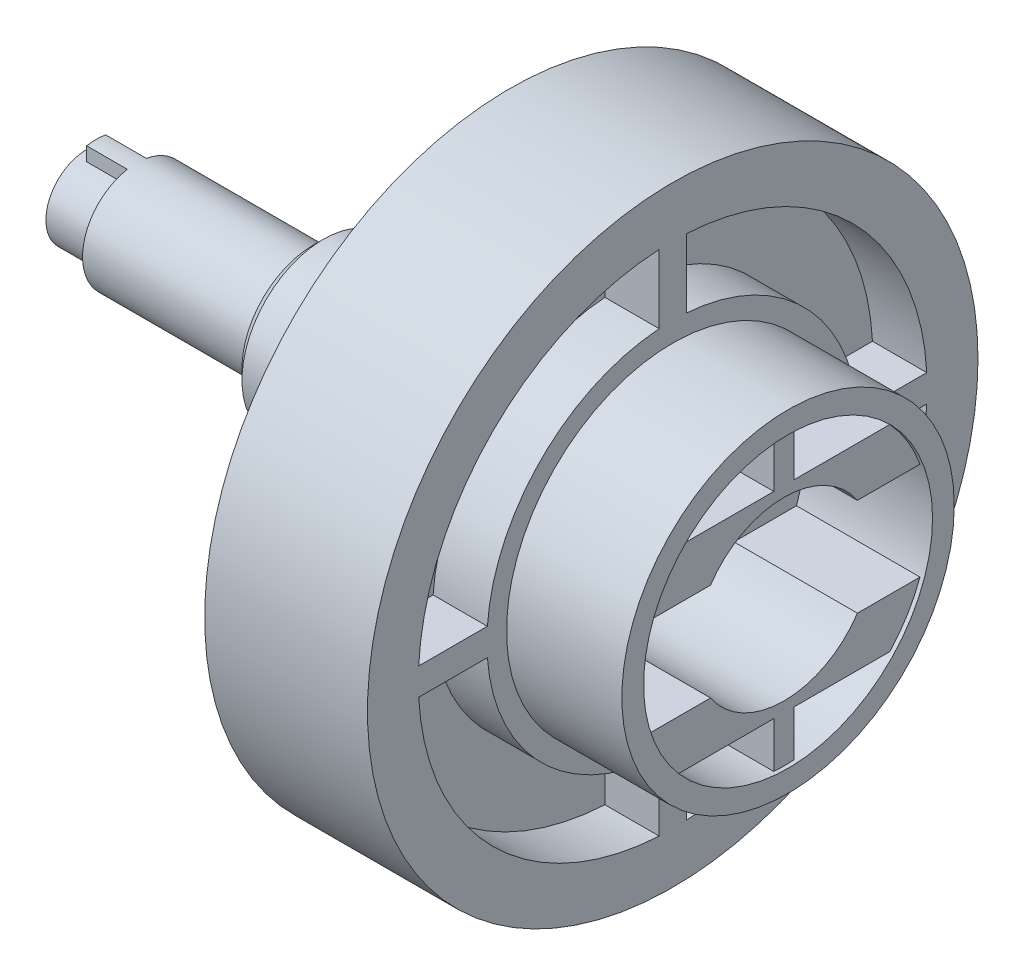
ISO-10303-21;
HEADER;
FILE_DESCRIPTION(('STEP AP214'),'2;1');
FILE_NAME('part.step','',(''),(''),'','','');
FILE_SCHEMA(('AUTOMOTIVE_DESIGN { 1 0 10303 214 1 1 1 1 }'));
ENDSEC;
DATA;
#1=APPLICATION_CONTEXT('core data for automotive mechanical design processes');
#2=APPLICATION_PROTOCOL_DEFINITION('international standard','automotive_design',2000,#1);
#3=PRODUCT_CONTEXT('',#1,'mechanical');
#4=PRODUCT('Part','Part','',(#3));
#5=PRODUCT_RELATED_PRODUCT_CATEGORY('part','',(#4));
#6=PRODUCT_DEFINITION_FORMATION('','',#4);
#7=PRODUCT_DEFINITION_CONTEXT('part definition',#1,'design');
#8=PRODUCT_DEFINITION('design','',#6,#7);
#9=PRODUCT_DEFINITION_SHAPE('','',#8);
#10=(LENGTH_UNIT() NAMED_UNIT(*) SI_UNIT(.MILLI.,.METRE.));
#11=(NAMED_UNIT(*) PLANE_ANGLE_UNIT() SI_UNIT($,.RADIAN.));
#12=(NAMED_UNIT(*) SI_UNIT($,.STERADIAN.) SOLID_ANGLE_UNIT());
#13=UNCERTAINTY_MEASURE_WITH_UNIT(LENGTH_MEASURE(1.E-05),#10,'distance_accuracy_value','');
#14=(GEOMETRIC_REPRESENTATION_CONTEXT(3) GLOBAL_UNCERTAINTY_ASSIGNED_CONTEXT((#13)) GLOBAL_UNIT_ASSIGNED_CONTEXT((#10,
#11,#12)) REPRESENTATION_CONTEXT('',''));
#15=CARTESIAN_POINT('',(0.,0.,0.));
#16=DIRECTION('',(0.,0.,1.));
#17=DIRECTION('',(1.,0.,0.));
#18=AXIS2_PLACEMENT_3D('',#15,#16,#17);
#19=CARTESIAN_POINT('',(70.,0.,0.));
#20=DIRECTION('',(1.,0.,0.));
#21=DIRECTION('',(0.,0.,-1.));
#22=AXIS2_PLACEMENT_3D('',#19,#20,#21);
#23=CYLINDRICAL_SURFACE('',#22,18.75);
#24=CARTESIAN_POINT('',(35.2,0.,0.));
#25=DIRECTION('',(1.,0.,0.));
#26=DIRECTION('',(0.,0.,-1.));
#27=AXIS2_PLACEMENT_3D('',#24,#25,#26);
#28=CIRCLE('',#27,18.75);
#29=CARTESIAN_POINT('',(35.2,18.7233143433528,1.));
#30=VERTEX_POINT('',#29);
#31=CARTESIAN_POINT('',(35.2,0.999999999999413,18.7233143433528));
#32=VERTEX_POINT('',#31);
#33=EDGE_CURVE('E485',#30,#32,#28,.T.);
#34=ORIENTED_EDGE('',*,*,#33,.T.);
#35=DIRECTION('',(1.,0.,0.));
#36=VECTOR('',#35,1.);
#37=CARTESIAN_POINT('',(70.,0.999999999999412,18.7233143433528));
#38=LINE('',#37,#36);
#39=CARTESIAN_POINT('',(31.2,0.999999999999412,18.7233143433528));
#40=VERTEX_POINT('',#39);
#41=EDGE_CURVE('E471',#32,#40,#38,.F.);
#42=ORIENTED_EDGE('',*,*,#41,.T.);
#43=CARTESIAN_POINT('',(31.2,0.,0.));
#44=DIRECTION('',(1.,0.,0.));
#45=DIRECTION('',(0.,0.,-1.));
#46=AXIS2_PLACEMENT_3D('',#43,#44,#45);
#47=CIRCLE('',#46,18.75);
#48=CARTESIAN_POINT('',(31.2,18.7233143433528,1.));
#49=VERTEX_POINT('',#48);
#50=EDGE_CURVE('E483',#49,#40,#47,.T.);
#51=ORIENTED_EDGE('',*,*,#50,.F.);
#52=DIRECTION('',(1.,0.,0.));
#53=VECTOR('',#52,1.);
#54=CARTESIAN_POINT('',(70.,18.7233143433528,1.));
#55=LINE('',#54,#53);
#56=EDGE_CURVE('E877',#30,#49,#55,.F.);
#57=ORIENTED_EDGE('',*,*,#56,.F.);
#58=EDGE_LOOP('',(#34,#42,#51,#57));
#59=FACE_BOUND('',#58,.T.);
#60=ADVANCED_FACE('F29',(#59),#23,.F.);
#61=CARTESIAN_POINT('',(35.2,18.75,0.));
#62=DIRECTION('',(-1.,0.,0.));
#63=DIRECTION('',(0.,0.,1.));
#64=AXIS2_PLACEMENT_3D('',#61,#62,#63);
#65=PLANE('',#64);
#66=CARTESIAN_POINT('',(35.2,0.,0.));
#67=DIRECTION('',(1.,0.,0.));
#68=DIRECTION('',(0.,0.,-1.));
#69=AXIS2_PLACEMENT_3D('',#66,#67,#68);
#70=CIRCLE('',#69,12.);
#71=CARTESIAN_POINT('',(35.2,11.9582607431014,1.));
#72=VERTEX_POINT('',#71);
#73=CARTESIAN_POINT('',(35.2,0.999999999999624,11.9582607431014));
#74=VERTEX_POINT('',#73);
#75=EDGE_CURVE('E511',#72,#74,#70,.T.);
#76=ORIENTED_EDGE('',*,*,#75,.T.);
#77=DIRECTION('',(0.,0.,1.));
#78=VECTOR('',#77,1.);
#79=CARTESIAN_POINT('',(35.2,1.,-5.57764466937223E-13));
#80=LINE('',#79,#78);
#81=EDGE_CURVE('E487',#74,#32,#80,.T.);
#82=ORIENTED_EDGE('',*,*,#81,.T.);
#83=ORIENTED_EDGE('',*,*,#33,.F.);
#84=DIRECTION('',(0.,1.,0.));
#85=VECTOR('',#84,1.);
#86=CARTESIAN_POINT('',(35.2,18.75,1.));
#87=LINE('',#86,#85);
#88=EDGE_CURVE('E879',#72,#30,#87,.T.);
#89=ORIENTED_EDGE('',*,*,#88,.F.);
#90=EDGE_LOOP('',(#76,#82,#83,#89));
#91=FACE_BOUND('',#90,.T.);
#92=ADVANCED_FACE('F1038',(#91),#65,.T.);
#93=CARTESIAN_POINT('',(70.,0.,0.));
#94=DIRECTION('',(1.,0.,0.));
#95=DIRECTION('',(0.,0.,-1.));
#96=AXIS2_PLACEMENT_3D('',#93,#94,#95);
#97=CYLINDRICAL_SURFACE('',#96,12.);
#98=CARTESIAN_POINT('',(39.2,0.,0.));
#99=DIRECTION('',(1.,0.,0.));
#100=DIRECTION('',(0.,0.,-1.));
#101=AXIS2_PLACEMENT_3D('',#98,#99,#100);
#102=CIRCLE('',#101,12.);
#103=CARTESIAN_POINT('',(39.2,11.9582607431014,1.));
#104=VERTEX_POINT('',#103);
#105=CARTESIAN_POINT('',(39.2,0.999999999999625,11.9582607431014));
#106=VERTEX_POINT('',#105);
#107=EDGE_CURVE('E524',#104,#106,#102,.T.);
#108=ORIENTED_EDGE('',*,*,#107,.T.);
#109=DIRECTION('',(1.,0.,0.));
#110=VECTOR('',#109,1.);
#111=CARTESIAN_POINT('',(70.,0.999999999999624,11.9582607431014));
#112=LINE('',#111,#110);
#113=EDGE_CURVE('E982',#106,#74,#112,.F.);
#114=ORIENTED_EDGE('',*,*,#113,.T.);
#115=ORIENTED_EDGE('',*,*,#75,.F.);
#116=DIRECTION('',(1.,0.,0.));
#117=VECTOR('',#116,1.);
#118=CARTESIAN_POINT('',(70.,11.9582607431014,1.));
#119=LINE('',#118,#117);
#120=EDGE_CURVE('E881',#104,#72,#119,.F.);
#121=ORIENTED_EDGE('',*,*,#120,.F.);
#122=EDGE_LOOP('',(#108,#114,#115,#121));
#123=FACE_BOUND('',#122,.T.);
#124=ADVANCED_FACE('F1030',(#123),#97,.F.);
#125=CARTESIAN_POINT('',(39.2,12.,0.));
#126=DIRECTION('',(-1.,0.,0.));
#127=DIRECTION('',(0.,0.,1.));
#128=AXIS2_PLACEMENT_3D('',#125,#126,#127);
#129=PLANE('',#128);
#130=CARTESIAN_POINT('',(39.2,0.,0.));
#131=DIRECTION('',(1.,0.,0.));
#132=DIRECTION('',(0.,0.,-1.));
#133=AXIS2_PLACEMENT_3D('',#130,#131,#132);
#134=CIRCLE('',#133,9.24999999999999);
#135=CARTESIAN_POINT('',(39.2,9.19578707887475,1.));
#136=VERTEX_POINT('',#135);
#137=CARTESIAN_POINT('',(39.2,0.999999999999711,9.19578707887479));
#138=VERTEX_POINT('',#137);
#139=EDGE_CURVE('E538',#136,#138,#134,.T.);
#140=ORIENTED_EDGE('',*,*,#139,.T.);
#141=DIRECTION('',(0.,0.,1.));
#142=VECTOR('',#141,1.);
#143=CARTESIAN_POINT('',(39.2,1.,-3.45656852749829E-13));
#144=LINE('',#143,#142);
#145=EDGE_CURVE('E44',#138,#106,#144,.T.);
#146=ORIENTED_EDGE('',*,*,#145,.T.);
#147=ORIENTED_EDGE('',*,*,#107,.F.);
#148=DIRECTION('',(0.,1.,0.));
#149=VECTOR('',#148,1.);
#150=CARTESIAN_POINT('',(39.2,12.,1.));
#151=LINE('',#150,#149);
#152=EDGE_CURVE('E884',#136,#104,#151,.T.);
#153=ORIENTED_EDGE('',*,*,#152,.F.);
#154=EDGE_LOOP('',(#140,#146,#147,#153));
#155=FACE_BOUND('',#154,.T.);
#156=ADVANCED_FACE('F1019',(#155),#129,.T.);
#157=DIRECTION('',(1.,0.,0.));
#158=VECTOR('',#157,1.);
#159=CARTESIAN_POINT('',(70.,-1.00000000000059,18.7233143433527));
#160=LINE('',#159,#158);
#161=CARTESIAN_POINT('',(35.2,-1.00000000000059,18.7233143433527));
#162=VERTEX_POINT('',#161);
#163=CARTESIAN_POINT('',(31.2,-1.00000000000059,18.7233143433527));
#164=VERTEX_POINT('',#163);
#165=EDGE_CURVE('E969',#162,#164,#160,.F.);
#166=ORIENTED_EDGE('',*,*,#165,.F.);
#167=CARTESIAN_POINT('',(35.2,-18.7233143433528,0.999999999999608));
#168=VERTEX_POINT('',#167);
#169=EDGE_CURVE('E507',#162,#168,#28,.T.);
#170=ORIENTED_EDGE('',*,*,#169,.T.);
#171=DIRECTION('',(1.,0.,0.));
#172=VECTOR('',#171,1.);
#173=CARTESIAN_POINT('',(70.,-18.7233143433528,0.999999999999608));
#174=LINE('',#173,#172);
#175=CARTESIAN_POINT('',(31.2,-18.7233143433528,0.999999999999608));
#176=VERTEX_POINT('',#175);
#177=EDGE_CURVE('E936',#168,#176,#174,.F.);
#178=ORIENTED_EDGE('',*,*,#177,.T.);
#179=EDGE_CURVE('E495',#164,#176,#47,.T.);
#180=ORIENTED_EDGE('',*,*,#179,.F.);
#181=EDGE_LOOP('',(#166,#170,#178,#180));
#182=FACE_BOUND('',#181,.T.);
#183=ADVANCED_FACE('F1004',(#182),#23,.F.);
#184=DIRECTION('',(0.,0.,1.));
#185=VECTOR('',#184,1.);
#186=CARTESIAN_POINT('',(35.2,-1.,-6.20611167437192E-13));
#187=LINE('',#186,#185);
#188=CARTESIAN_POINT('',(35.2,-1.00000000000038,11.9582607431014));
#189=VERTEX_POINT('',#188);
#190=EDGE_CURVE('E971',#189,#162,#187,.T.);
#191=ORIENTED_EDGE('',*,*,#190,.F.);
#192=CARTESIAN_POINT('',(35.2,-11.9582607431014,0.99999999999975));
#193=VERTEX_POINT('',#192);
#194=EDGE_CURVE('E518',#189,#193,#70,.T.);
#195=ORIENTED_EDGE('',*,*,#194,.T.);
#196=DIRECTION('',(0.,-1.,0.));
#197=VECTOR('',#196,1.);
#198=CARTESIAN_POINT('',(35.2,18.75,1.00000000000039));
#199=LINE('',#198,#197);
#200=EDGE_CURVE('E939',#193,#168,#199,.T.);
#201=ORIENTED_EDGE('',*,*,#200,.T.);
#202=ORIENTED_EDGE('',*,*,#169,.F.);
#203=EDGE_LOOP('',(#191,#195,#201,#202));
#204=FACE_BOUND('',#203,.T.);
#205=ADVANCED_FACE('F1008',(#204),#65,.T.);
#206=DIRECTION('',(1.,0.,0.));
#207=VECTOR('',#206,1.);
#208=CARTESIAN_POINT('',(70.,-1.00000000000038,11.9582607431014));
#209=LINE('',#208,#207);
#210=CARTESIAN_POINT('',(39.2,-1.00000000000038,11.9582607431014));
#211=VERTEX_POINT('',#210);
#212=EDGE_CURVE('E973',#211,#189,#209,.F.);
#213=ORIENTED_EDGE('',*,*,#212,.F.);
#214=CARTESIAN_POINT('',(39.2,-11.9582607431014,0.99999999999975));
#215=VERTEX_POINT('',#214);
#216=EDGE_CURVE('E530',#211,#215,#102,.T.);
#217=ORIENTED_EDGE('',*,*,#216,.T.);
#218=DIRECTION('',(1.,0.,0.));
#219=VECTOR('',#218,1.);
#220=CARTESIAN_POINT('',(70.,-11.9582607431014,0.99999999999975));
#221=LINE('',#220,#219);
#222=EDGE_CURVE('E940',#215,#193,#221,.F.);
#223=ORIENTED_EDGE('',*,*,#222,.T.);
#224=ORIENTED_EDGE('',*,*,#194,.F.);
#225=EDGE_LOOP('',(#213,#217,#223,#224));
#226=FACE_BOUND('',#225,.T.);
#227=ADVANCED_FACE('F1012',(#226),#97,.F.);
#228=DIRECTION('',(0.,0.,1.));
#229=VECTOR('',#228,1.);
#230=CARTESIAN_POINT('',(39.2,-1.,-4.08503553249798E-13));
#231=LINE('',#230,#229);
#232=CARTESIAN_POINT('',(39.2,-1.00000000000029,9.19578707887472));
#233=VERTEX_POINT('',#232);
#234=EDGE_CURVE('E976',#233,#211,#231,.T.);
#235=ORIENTED_EDGE('',*,*,#234,.F.);
#236=CARTESIAN_POINT('',(39.2,-9.19578707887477,0.999999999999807));
#237=VERTEX_POINT('',#236);
#238=EDGE_CURVE('E52',#233,#237,#134,.T.);
#239=ORIENTED_EDGE('',*,*,#238,.T.);
#240=DIRECTION('',(0.,-1.,0.));
#241=VECTOR('',#240,1.);
#242=CARTESIAN_POINT('',(39.2,12.,1.00000000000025));
#243=LINE('',#242,#241);
#244=EDGE_CURVE('E943',#237,#215,#243,.T.);
#245=ORIENTED_EDGE('',*,*,#244,.T.);
#246=ORIENTED_EDGE('',*,*,#216,.F.);
#247=EDGE_LOOP('',(#235,#239,#245,#246));
#248=FACE_BOUND('',#247,.T.);
#249=ADVANCED_FACE('F1014',(#248),#129,.T.);
#250=DIRECTION('',(1.,0.,0.));
#251=VECTOR('',#250,1.);
#252=CARTESIAN_POINT('',(70.,-18.7233143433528,-1.00000000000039));
#253=LINE('',#252,#251);
#254=CARTESIAN_POINT('',(35.2,-18.7233143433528,-1.00000000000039));
#255=VERTEX_POINT('',#254);
#256=CARTESIAN_POINT('',(31.2,-18.7233143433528,-1.00000000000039));
#257=VERTEX_POINT('',#256);
#258=EDGE_CURVE('E952',#255,#257,#253,.F.);
#259=ORIENTED_EDGE('',*,*,#258,.F.);
#260=CARTESIAN_POINT('',(35.2,-0.999999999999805,-18.7233143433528));
#261=VERTEX_POINT('',#260);
#262=EDGE_CURVE('E509',#255,#261,#28,.T.);
#263=ORIENTED_EDGE('',*,*,#262,.T.);
#264=DIRECTION('',(1.,0.,0.));
#265=VECTOR('',#264,1.);
#266=CARTESIAN_POINT('',(70.,-0.999999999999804,-18.7233143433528));
#267=LINE('',#266,#265);
#268=CARTESIAN_POINT('',(31.2,-0.999999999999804,-18.7233143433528));
#269=VERTEX_POINT('',#268);
#270=EDGE_CURVE('E904',#261,#269,#267,.F.);
#271=ORIENTED_EDGE('',*,*,#270,.T.);
#272=EDGE_CURVE('E501',#257,#269,#47,.T.);
#273=ORIENTED_EDGE('',*,*,#272,.F.);
#274=EDGE_LOOP('',(#259,#263,#271,#273));
#275=FACE_BOUND('',#274,.T.);
#276=ADVANCED_FACE('F1016',(#275),#23,.F.);
#277=DIRECTION('',(0.,-1.,0.));
#278=VECTOR('',#277,1.);
#279=CARTESIAN_POINT('',(35.2,18.75,-0.999999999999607));
#280=LINE('',#279,#278);
#281=CARTESIAN_POINT('',(35.2,-11.9582607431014,-1.00000000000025));
#282=VERTEX_POINT('',#281);
#283=EDGE_CURVE('E954',#282,#255,#280,.T.);
#284=ORIENTED_EDGE('',*,*,#283,.F.);
#285=CARTESIAN_POINT('',(35.2,-0.999999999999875,-11.9582607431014));
#286=VERTEX_POINT('',#285);
#287=EDGE_CURVE('E522',#282,#286,#70,.T.);
#288=ORIENTED_EDGE('',*,*,#287,.T.);
#289=DIRECTION('',(0.,0.,-1.));
#290=VECTOR('',#289,1.);
#291=CARTESIAN_POINT('',(35.2,-1.,-2.06870389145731E-13));
#292=LINE('',#291,#290);
#293=EDGE_CURVE('E907',#286,#261,#292,.T.);
#294=ORIENTED_EDGE('',*,*,#293,.T.);
#295=ORIENTED_EDGE('',*,*,#262,.F.);
#296=EDGE_LOOP('',(#284,#288,#294,#295));
#297=FACE_BOUND('',#296,.T.);
#298=ADVANCED_FACE('F1024',(#297),#65,.T.);
#299=DIRECTION('',(1.,0.,0.));
#300=VECTOR('',#299,1.);
#301=CARTESIAN_POINT('',(70.,-11.9582607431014,-1.00000000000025));
#302=LINE('',#301,#300);
#303=CARTESIAN_POINT('',(39.2,-11.9582607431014,-1.00000000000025));
#304=VERTEX_POINT('',#303);
#305=EDGE_CURVE('E956',#304,#282,#302,.F.);
#306=ORIENTED_EDGE('',*,*,#305,.F.);
#307=CARTESIAN_POINT('',(39.2,-0.999999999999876,-11.9582607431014));
#308=VERTEX_POINT('',#307);
#309=EDGE_CURVE('E536',#304,#308,#102,.T.);
#310=ORIENTED_EDGE('',*,*,#309,.T.);
#311=DIRECTION('',(1.,0.,0.));
#312=VECTOR('',#311,1.);
#313=CARTESIAN_POINT('',(70.,-0.999999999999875,-11.9582607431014));
#314=LINE('',#313,#312);
#315=EDGE_CURVE('E910',#308,#286,#314,.F.);
#316=ORIENTED_EDGE('',*,*,#315,.T.);
#317=ORIENTED_EDGE('',*,*,#287,.F.);
#318=EDGE_LOOP('',(#306,#310,#316,#317));
#319=FACE_BOUND('',#318,.T.);
#320=ADVANCED_FACE('F1029',(#319),#97,.F.);
#321=DIRECTION('',(0.,-1.,0.));
#322=VECTOR('',#321,1.);
#323=CARTESIAN_POINT('',(39.2,12.,-0.999999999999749));
#324=LINE('',#323,#322);
#325=CARTESIAN_POINT('',(39.2,-9.19578707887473,-1.00000000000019));
#326=VERTEX_POINT('',#325);
#327=EDGE_CURVE('E959',#326,#304,#324,.T.);
#328=ORIENTED_EDGE('',*,*,#327,.F.);
#329=CARTESIAN_POINT('',(39.2,-0.999999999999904,-9.19578707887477));
#330=VERTEX_POINT('',#329);
#331=EDGE_CURVE('E549',#326,#330,#134,.T.);
#332=ORIENTED_EDGE('',*,*,#331,.T.);
#333=DIRECTION('',(0.,0.,-1.));
#334=VECTOR('',#333,1.);
#335=CARTESIAN_POINT('',(39.2,-1.,-1.36167851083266E-13));
#336=LINE('',#335,#334);
#337=EDGE_CURVE('E913',#330,#308,#336,.T.);
#338=ORIENTED_EDGE('',*,*,#337,.T.);
#339=ORIENTED_EDGE('',*,*,#309,.F.);
#340=EDGE_LOOP('',(#328,#332,#338,#339));
#341=FACE_BOUND('',#340,.T.);
#342=ADVANCED_FACE('F1018',(#341),#129,.T.);
#343=CARTESIAN_POINT('',(70.,0.,0.));
#344=DIRECTION('',(1.,0.,0.));
#345=DIRECTION('',(0.,0.,-1.));
#346=AXIS2_PLACEMENT_3D('',#343,#344,#345);
#347=CYLINDRICAL_SURFACE('',#346,13.7);
#348=CARTESIAN_POINT('',(39.2,0.,0.));
#349=DIRECTION('',(1.,0.,0.));
#350=DIRECTION('',(0.,0.,-1.));
#351=AXIS2_PLACEMENT_3D('',#348,#349,#350);
#352=CIRCLE('',#351,13.7);
#353=CARTESIAN_POINT('',(39.2,-13.6634549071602,-0.999999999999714));
#354=VERTEX_POINT('',#353);
#355=CARTESIAN_POINT('',(39.2,-1.00000000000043,-13.6634549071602));
#356=VERTEX_POINT('',#355);
#357=EDGE_CURVE('E1899',#354,#356,#352,.T.);
#358=ORIENTED_EDGE('',*,*,#357,.T.);
#359=DIRECTION('',(1.,0.,0.));
#360=VECTOR('',#359,1.);
#361=CARTESIAN_POINT('',(70.,-1.00000000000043,-13.6634549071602));
#362=LINE('',#361,#360);
#363=CARTESIAN_POINT('',(43.2,-1.00000000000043,-13.6634549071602));
#364=VERTEX_POINT('',#363);
#365=EDGE_CURVE('E854',#356,#364,#362,.T.);
#366=ORIENTED_EDGE('',*,*,#365,.T.);
#367=CARTESIAN_POINT('',(43.2,0.,0.));
#368=DIRECTION('',(1.,0.,0.));
#369=DIRECTION('',(0.,0.,-1.));
#370=AXIS2_PLACEMENT_3D('',#367,#368,#369);
#371=CIRCLE('',#370,13.7);
#372=CARTESIAN_POINT('',(43.2,-13.6634549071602,-0.999999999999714));
#373=VERTEX_POINT('',#372);
#374=EDGE_CURVE('E1865',#373,#364,#371,.T.);
#375=ORIENTED_EDGE('',*,*,#374,.F.);
#376=DIRECTION('',(1.,0.,0.));
#377=VECTOR('',#376,1.);
#378=CARTESIAN_POINT('',(70.,-13.6634549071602,-0.999999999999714));
#379=LINE('',#378,#377);
#380=EDGE_CURVE('E842',#354,#373,#379,.T.);
#381=ORIENTED_EDGE('',*,*,#380,.F.);
#382=EDGE_LOOP('',(#358,#366,#375,#381));
#383=FACE_BOUND('',#382,.T.);
#384=ADVANCED_FACE('F1034',(#383),#347,.T.);
#385=CARTESIAN_POINT('',(39.2,13.7,0.));
#386=DIRECTION('',(1.,0.,0.));
#387=DIRECTION('',(0.,0.,-1.));
#388=AXIS2_PLACEMENT_3D('',#385,#386,#387);
#389=PLANE('',#388);
#390=CARTESIAN_POINT('',(39.2,0.,0.));
#391=DIRECTION('',(1.,0.,0.));
#392=DIRECTION('',(0.,0.,-1.));
#393=AXIS2_PLACEMENT_3D('',#390,#391,#392);
#394=CIRCLE('',#393,18.75);
#395=CARTESIAN_POINT('',(39.2,-18.7233143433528,-0.999999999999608));
#396=VERTEX_POINT('',#395);
#397=CARTESIAN_POINT('',(39.2,-1.00000000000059,-18.7233143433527));
#398=VERTEX_POINT('',#397);
#399=EDGE_CURVE('E1892',#396,#398,#394,.T.);
#400=ORIENTED_EDGE('',*,*,#399,.T.);
#401=DIRECTION('',(0.,0.,1.));
#402=VECTOR('',#401,1.);
#403=CARTESIAN_POINT('',(39.2,-0.999999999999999,4.61923248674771E-13));
#404=LINE('',#403,#402);
#405=EDGE_CURVE('E857',#398,#356,#404,.T.);
#406=ORIENTED_EDGE('',*,*,#405,.T.);
#407=ORIENTED_EDGE('',*,*,#357,.F.);
#408=DIRECTION('',(0.,1.,0.));
#409=VECTOR('',#408,1.);
#410=CARTESIAN_POINT('',(39.2,13.7,-1.00000000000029));
#411=LINE('',#410,#409);
#412=EDGE_CURVE('E845',#396,#354,#411,.T.);
#413=ORIENTED_EDGE('',*,*,#412,.F.);
#414=EDGE_LOOP('',(#400,#406,#407,#413));
#415=FACE_BOUND('',#414,.T.);
#416=ADVANCED_FACE('F1723',(#415),#389,.T.);
#417=CARTESIAN_POINT('',(70.,0.,0.));
#418=DIRECTION('',(1.,0.,0.));
#419=DIRECTION('',(0.,0.,-1.));
#420=AXIS2_PLACEMENT_3D('',#417,#418,#419);
#421=CYLINDRICAL_SURFACE('',#420,18.75);
#422=CARTESIAN_POINT('',(43.2,0.,0.));
#423=DIRECTION('',(1.,0.,0.));
#424=DIRECTION('',(0.,0.,-1.));
#425=AXIS2_PLACEMENT_3D('',#422,#423,#424);
#426=CIRCLE('',#425,18.75);
#427=CARTESIAN_POINT('',(43.2,-18.7233143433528,-0.999999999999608));
#428=VERTEX_POINT('',#427);
#429=CARTESIAN_POINT('',(43.2,-1.00000000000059,-18.7233143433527));
#430=VERTEX_POINT('',#429);
#431=EDGE_CURVE('E1758',#428,#430,#426,.T.);
#432=ORIENTED_EDGE('',*,*,#431,.T.);
#433=DIRECTION('',(1.,0.,0.));
#434=VECTOR('',#433,1.);
#435=CARTESIAN_POINT('',(70.,-1.00000000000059,-18.7233143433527));
#436=LINE('',#435,#434);
#437=EDGE_CURVE('E860',#430,#398,#436,.F.);
#438=ORIENTED_EDGE('',*,*,#437,.T.);
#439=ORIENTED_EDGE('',*,*,#399,.F.);
#440=DIRECTION('',(1.,0.,0.));
#441=VECTOR('',#440,1.);
#442=CARTESIAN_POINT('',(70.,-18.7233143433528,-0.999999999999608));
#443=LINE('',#442,#441);
#444=EDGE_CURVE('E847',#428,#396,#443,.F.);
#445=ORIENTED_EDGE('',*,*,#444,.F.);
#446=EDGE_LOOP('',(#432,#438,#439,#445));
#447=FACE_BOUND('',#446,.T.);
#448=ADVANCED_FACE('F1734',(#447),#421,.F.);
#449=CARTESIAN_POINT('',(39.2,-0.999999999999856,13.6634549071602));
#450=VERTEX_POINT('',#449);
#451=CARTESIAN_POINT('',(39.2,-13.6634549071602,1.00000000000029));
#452=VERTEX_POINT('',#451);
#453=EDGE_CURVE('E1774',#450,#452,#352,.T.);
#454=ORIENTED_EDGE('',*,*,#453,.T.);
#455=DIRECTION('',(1.,0.,0.));
#456=VECTOR('',#455,1.);
#457=CARTESIAN_POINT('',(70.,-13.6634549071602,1.00000000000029));
#458=LINE('',#457,#456);
#459=CARTESIAN_POINT('',(43.2,-13.6634549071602,1.00000000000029));
#460=VERTEX_POINT('',#459);
#461=EDGE_CURVE('E833',#452,#460,#458,.T.);
#462=ORIENTED_EDGE('',*,*,#461,.T.);
#463=CARTESIAN_POINT('',(43.2,-0.999999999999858,13.6634549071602));
#464=VERTEX_POINT('',#463);
#465=EDGE_CURVE('E1779',#464,#460,#371,.T.);
#466=ORIENTED_EDGE('',*,*,#465,.F.);
#467=DIRECTION('',(1.,0.,0.));
#468=VECTOR('',#467,1.);
#469=CARTESIAN_POINT('',(70.,-0.999999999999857,13.6634549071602));
#470=LINE('',#469,#468);
#471=EDGE_CURVE('E812',#450,#464,#470,.T.);
#472=ORIENTED_EDGE('',*,*,#471,.F.);
#473=EDGE_LOOP('',(#454,#462,#466,#472));
#474=FACE_BOUND('',#473,.T.);
#475=ADVANCED_FACE('F1884',(#474),#347,.T.);
#476=CARTESIAN_POINT('',(39.2,-0.999999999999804,18.7233143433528));
#477=VERTEX_POINT('',#476);
#478=CARTESIAN_POINT('',(39.2,-18.7233143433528,1.00000000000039));
#479=VERTEX_POINT('',#478);
#480=EDGE_CURVE('E1769',#477,#479,#394,.T.);
#481=ORIENTED_EDGE('',*,*,#480,.T.);
#482=DIRECTION('',(0.,1.,0.));
#483=VECTOR('',#482,1.);
#484=CARTESIAN_POINT('',(39.2,13.7,0.999999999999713));
#485=LINE('',#484,#483);
#486=EDGE_CURVE('E836',#479,#452,#485,.T.);
#487=ORIENTED_EDGE('',*,*,#486,.T.);
#488=ORIENTED_EDGE('',*,*,#453,.F.);
#489=DIRECTION('',(0.,0.,-1.));
#490=VECTOR('',#489,1.);
#491=CARTESIAN_POINT('',(39.2,-0.999999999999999,1.53974416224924E-13));
#492=LINE('',#491,#490);
#493=EDGE_CURVE('E815',#477,#450,#492,.T.);
#494=ORIENTED_EDGE('',*,*,#493,.F.);
#495=EDGE_LOOP('',(#481,#487,#488,#494));
#496=FACE_BOUND('',#495,.T.);
#497=ADVANCED_FACE('F1888',(#496),#389,.T.);
#498=CARTESIAN_POINT('',(43.2,-0.999999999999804,18.7233143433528));
#499=VERTEX_POINT('',#498);
#500=CARTESIAN_POINT('',(43.2,-18.7233143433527,1.00000000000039));
#501=VERTEX_POINT('',#500);
#502=EDGE_CURVE('E1764',#499,#501,#426,.T.);
#503=ORIENTED_EDGE('',*,*,#502,.T.);
#504=DIRECTION('',(1.,0.,0.));
#505=VECTOR('',#504,1.);
#506=CARTESIAN_POINT('',(70.,-18.7233143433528,1.00000000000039));
#507=LINE('',#506,#505);
#508=EDGE_CURVE('E839',#501,#479,#507,.F.);
#509=ORIENTED_EDGE('',*,*,#508,.T.);
#510=ORIENTED_EDGE('',*,*,#480,.F.);
#511=DIRECTION('',(1.,0.,0.));
#512=VECTOR('',#511,1.);
#513=CARTESIAN_POINT('',(70.,-0.999999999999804,18.7233143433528));
#514=LINE('',#513,#512);
#515=EDGE_CURVE('E817',#499,#477,#514,.F.);
#516=ORIENTED_EDGE('',*,*,#515,.F.);
#517=EDGE_LOOP('',(#503,#509,#510,#516));
#518=FACE_BOUND('',#517,.T.);
#519=ADVANCED_FACE('F1908',(#518),#421,.F.);
#520=CARTESIAN_POINT('',(39.2,13.6634549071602,1.));
#521=VERTEX_POINT('',#520);
#522=CARTESIAN_POINT('',(39.2,1.00000000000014,13.6634549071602));
#523=VERTEX_POINT('',#522);
#524=EDGE_CURVE('E1770',#521,#523,#352,.T.);
#525=ORIENTED_EDGE('',*,*,#524,.T.);
#526=DIRECTION('',(1.,0.,0.));
#527=VECTOR('',#526,1.);
#528=CARTESIAN_POINT('',(70.,1.00000000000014,13.6634549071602));
#529=LINE('',#528,#527);
#530=CARTESIAN_POINT('',(43.2,1.00000000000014,13.6634549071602));
#531=VERTEX_POINT('',#530);
#532=EDGE_CURVE('E820',#523,#531,#529,.T.);
#533=ORIENTED_EDGE('',*,*,#532,.T.);
#534=CARTESIAN_POINT('',(43.2,13.6634549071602,1.));
#535=VERTEX_POINT('',#534);
#536=EDGE_CURVE('E1775',#535,#531,#371,.T.);
#537=ORIENTED_EDGE('',*,*,#536,.F.);
#538=DIRECTION('',(1.,0.,0.));
#539=VECTOR('',#538,1.);
#540=CARTESIAN_POINT('',(70.,13.6634549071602,1.));
#541=LINE('',#540,#539);
#542=EDGE_CURVE('E788',#521,#535,#541,.T.);
#543=ORIENTED_EDGE('',*,*,#542,.F.);
#544=EDGE_LOOP('',(#525,#533,#537,#543));
#545=FACE_BOUND('',#544,.T.);
#546=ADVANCED_FACE('F1712',(#545),#347,.T.);
#547=CARTESIAN_POINT('',(39.2,18.7233143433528,1.));
#548=VERTEX_POINT('',#547);
#549=CARTESIAN_POINT('',(39.2,1.0000000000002,18.7233143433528));
#550=VERTEX_POINT('',#549);
#551=EDGE_CURVE('E1765',#548,#550,#394,.T.);
#552=ORIENTED_EDGE('',*,*,#551,.T.);
#553=DIRECTION('',(0.,0.,-1.));
#554=VECTOR('',#553,1.);
#555=CARTESIAN_POINT('',(39.2,0.999999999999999,1.33025516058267E-13));
#556=LINE('',#555,#554);
#557=EDGE_CURVE('E823',#550,#523,#556,.T.);
#558=ORIENTED_EDGE('',*,*,#557,.T.);
#559=ORIENTED_EDGE('',*,*,#524,.F.);
#560=DIRECTION('',(0.,-1.,0.));
#561=VECTOR('',#560,1.);
#562=CARTESIAN_POINT('',(39.2,13.7,1.));
#563=LINE('',#562,#561);
#564=EDGE_CURVE('E791',#548,#521,#563,.T.);
#565=ORIENTED_EDGE('',*,*,#564,.F.);
#566=EDGE_LOOP('',(#552,#558,#559,#565));
#567=FACE_BOUND('',#566,.T.);
#568=ADVANCED_FACE('F1724',(#567),#389,.T.);
#569=CARTESIAN_POINT('',(43.2,18.7233143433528,1.));
#570=VERTEX_POINT('',#569);
#571=CARTESIAN_POINT('',(43.2,1.0000000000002,18.7233143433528));
#572=VERTEX_POINT('',#571);
#573=EDGE_CURVE('E1760',#570,#572,#426,.T.);
#574=ORIENTED_EDGE('',*,*,#573,.T.);
#575=DIRECTION('',(1.,0.,0.));
#576=VECTOR('',#575,1.);
#577=CARTESIAN_POINT('',(70.,1.0000000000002,18.7233143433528));
#578=LINE('',#577,#576);
#579=EDGE_CURVE('E826',#572,#550,#578,.F.);
#580=ORIENTED_EDGE('',*,*,#579,.T.);
#581=ORIENTED_EDGE('',*,*,#551,.F.);
#582=DIRECTION('',(1.,0.,0.));
#583=VECTOR('',#582,1.);
#584=CARTESIAN_POINT('',(70.,18.7233143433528,1.));
#585=LINE('',#584,#583);
#586=EDGE_CURVE('E794',#570,#548,#585,.F.);
#587=ORIENTED_EDGE('',*,*,#586,.F.);
#588=EDGE_LOOP('',(#574,#580,#581,#587));
#589=FACE_BOUND('',#588,.T.);
#590=ADVANCED_FACE('F1270',(#589),#421,.F.);
#591=CARTESIAN_POINT('',(3.70000000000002,3.99999999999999,0.));
#592=DIRECTION('',(-1.,0.,0.));
#593=DIRECTION('',(0.,0.,1.));
#594=AXIS2_PLACEMENT_3D('',#591,#592,#593);
#595=PLANE('',#594);
#596=CARTESIAN_POINT('',(3.70000000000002,0.,0.));
#597=DIRECTION('',(1.,0.,0.));
#598=DIRECTION('',(0.,0.,-1.));
#599=AXIS2_PLACEMENT_3D('',#596,#597,#598);
#600=CIRCLE('',#599,2.99999999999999);
#601=CARTESIAN_POINT('',(3.70000000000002,-2.91719042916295,-0.699999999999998));
#602=VERTEX_POINT('',#601);
#603=CARTESIAN_POINT('',(3.70000000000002,0.,-2.99999999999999));
#604=VERTEX_POINT('',#603);
#605=EDGE_CURVE('E582',#602,#604,#600,.T.);
#606=ORIENTED_EDGE('',*,*,#605,.T.);
#607=DIRECTION('',(0.,1.,0.));
#608=VECTOR('',#607,1.);
#609=CARTESIAN_POINT('',(3.70000000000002,3.99999999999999,-3.));
#610=LINE('',#609,#608);
#611=CARTESIAN_POINT('',(3.70000000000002,-2.64575131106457,-3.));
#612=VERTEX_POINT('',#611);
#613=EDGE_CURVE('E727',#612,#604,#610,.T.);
#614=ORIENTED_EDGE('',*,*,#613,.F.);
#615=CARTESIAN_POINT('',(3.70000000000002,0.,0.));
#616=DIRECTION('',(1.,0.,0.));
#617=DIRECTION('',(0.,0.,-1.));
#618=AXIS2_PLACEMENT_3D('',#615,#616,#617);
#619=CIRCLE('',#618,3.99999999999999);
#620=CARTESIAN_POINT('',(3.70000000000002,-3.93827373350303,-0.699999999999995));
#621=VERTEX_POINT('',#620);
#622=EDGE_CURVE('E578',#621,#612,#619,.T.);
#623=ORIENTED_EDGE('',*,*,#622,.F.);
#624=DIRECTION('',(0.,-1.,0.));
#625=VECTOR('',#624,1.);
#626=CARTESIAN_POINT('',(3.70000000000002,-2.91719042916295,-0.699999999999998));
#627=LINE('',#626,#625);
#628=EDGE_CURVE('E785',#602,#621,#627,.T.);
#629=ORIENTED_EDGE('',*,*,#628,.F.);
#630=EDGE_LOOP('',(#606,#614,#623,#629));
#631=FACE_BOUND('',#630,.T.);
#632=ADVANCED_FACE('F1267',(#631),#595,.T.);
#633=CARTESIAN_POINT('',(3.70000000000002,2.91719042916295,0.699999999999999));
#634=VERTEX_POINT('',#633);
#635=CARTESIAN_POINT('',(3.70000000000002,-2.91719042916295,0.699999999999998));
#636=VERTEX_POINT('',#635);
#637=EDGE_CURVE('E581',#634,#636,#600,.T.);
#638=ORIENTED_EDGE('',*,*,#637,.T.);
#639=DIRECTION('',(0.,1.,0.));
#640=VECTOR('',#639,1.);
#641=CARTESIAN_POINT('',(3.70000000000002,-2.91719042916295,0.699999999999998));
#642=LINE('',#641,#640);
#643=CARTESIAN_POINT('',(3.70000000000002,-3.93827373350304,0.699999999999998));
#644=VERTEX_POINT('',#643);
#645=EDGE_CURVE('E782',#644,#636,#642,.T.);
#646=ORIENTED_EDGE('',*,*,#645,.F.);
#647=CARTESIAN_POINT('',(3.70000000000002,3.93827373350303,0.699999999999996));
#648=VERTEX_POINT('',#647);
#649=EDGE_CURVE('E577',#648,#644,#619,.T.);
#650=ORIENTED_EDGE('',*,*,#649,.F.);
#651=DIRECTION('',(0.,1.,0.));
#652=VECTOR('',#651,1.);
#653=CARTESIAN_POINT('',(3.70000000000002,3.93827373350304,0.699999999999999));
#654=LINE('',#653,#652);
#655=EDGE_CURVE('E760',#634,#648,#654,.T.);
#656=ORIENTED_EDGE('',*,*,#655,.F.);
#657=EDGE_LOOP('',(#638,#646,#650,#656));
#658=FACE_BOUND('',#657,.T.);
#659=ADVANCED_FACE('F1265',(#658),#595,.T.);
#660=CARTESIAN_POINT('',(70.,0.,0.));
#661=DIRECTION('',(1.,0.,0.));
#662=DIRECTION('',(0.,0.,-1.));
#663=AXIS2_PLACEMENT_3D('',#660,#661,#662);
#664=CYLINDRICAL_SURFACE('',#663,2.99999999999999);
#665=CARTESIAN_POINT('',(0.,0.,0.));
#666=DIRECTION('',(1.,0.,0.));
#667=DIRECTION('',(0.,0.,-1.));
#668=AXIS2_PLACEMENT_3D('',#665,#666,#667);
#669=CIRCLE('',#668,2.99999999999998);
#670=CARTESIAN_POINT('',(0.,0.,-2.99999999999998));
#671=VERTEX_POINT('',#670);
#672=EDGE_CURVE('E583',#671,#671,#669,.T.);
#673=ORIENTED_EDGE('',*,*,#672,.T.);
#674=EDGE_LOOP('',(#673));
#675=FACE_BOUND('',#674,.T.);
#676=DIRECTION('',(1.,0.,0.));
#677=VECTOR('',#676,1.);
#678=CARTESIAN_POINT('',(0.700000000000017,-2.91719042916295,0.699999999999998));
#679=LINE('',#678,#677);
#680=CARTESIAN_POINT('',(0.700000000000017,-2.91719042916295,0.699999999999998));
#681=VERTEX_POINT('',#680);
#682=EDGE_CURVE('E770',#681,#636,#679,.T.);
#683=ORIENTED_EDGE('',*,*,#682,.T.);
#684=ORIENTED_EDGE('',*,*,#637,.F.);
#685=DIRECTION('',(1.,0.,0.));
#686=VECTOR('',#685,1.);
#687=CARTESIAN_POINT('',(0.700000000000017,2.91719042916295,0.699999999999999));
#688=LINE('',#687,#686);
#689=CARTESIAN_POINT('',(0.700000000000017,2.91719042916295,0.699999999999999));
#690=VERTEX_POINT('',#689);
#691=EDGE_CURVE('E735',#690,#634,#688,.T.);
#692=ORIENTED_EDGE('',*,*,#691,.F.);
#693=CARTESIAN_POINT('',(0.700000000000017,0.,0.));
#694=DIRECTION('',(1.,0.,0.));
#695=DIRECTION('',(0.,0.,1.));
#696=AXIS2_PLACEMENT_3D('',#693,#694,#695);
#697=CIRCLE('',#696,2.99999999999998);
#698=CARTESIAN_POINT('',(0.70000000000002,2.91719042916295,-0.699999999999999));
#699=VERTEX_POINT('',#698);
#700=EDGE_CURVE('E754',#699,#690,#697,.T.);
#701=ORIENTED_EDGE('',*,*,#700,.F.);
#702=DIRECTION('',(1.,0.,0.));
#703=VECTOR('',#702,1.);
#704=CARTESIAN_POINT('',(0.700000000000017,2.91719042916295,-0.699999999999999));
#705=LINE('',#704,#703);
#706=CARTESIAN_POINT('',(3.70000000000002,2.91719042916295,-0.699999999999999));
#707=VERTEX_POINT('',#706);
#708=EDGE_CURVE('E744',#699,#707,#705,.T.);
#709=ORIENTED_EDGE('',*,*,#708,.T.);
#710=EDGE_CURVE('E579',#604,#707,#600,.T.);
#711=ORIENTED_EDGE('',*,*,#710,.F.);
#712=ORIENTED_EDGE('',*,*,#605,.F.);
#713=DIRECTION('',(1.,0.,0.));
#714=VECTOR('',#713,1.);
#715=CARTESIAN_POINT('',(0.700000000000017,-2.91719042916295,-0.699999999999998));
#716=LINE('',#715,#714);
#717=CARTESIAN_POINT('',(0.700000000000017,-2.91719042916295,-0.699999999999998));
#718=VERTEX_POINT('',#717);
#719=EDGE_CURVE('E763',#718,#602,#716,.T.);
#720=ORIENTED_EDGE('',*,*,#719,.F.);
#721=CARTESIAN_POINT('',(0.700000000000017,0.,0.));
#722=DIRECTION('',(1.,0.,0.));
#723=DIRECTION('',(0.,0.,1.));
#724=AXIS2_PLACEMENT_3D('',#721,#722,#723);
#725=CIRCLE('',#724,2.99999999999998);
#726=EDGE_CURVE('E779',#681,#718,#725,.T.);
#727=ORIENTED_EDGE('',*,*,#726,.F.);
#728=EDGE_LOOP('',(#683,#684,#692,#701,#709,#711,#712,#720,#727));
#729=FACE_BOUND('',#728,.T.);
#730=ADVANCED_FACE('F1261',(#675,#729),#664,.T.);
#731=CARTESIAN_POINT('',(3.70000000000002,2.64575131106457,-3.));
#732=VERTEX_POINT('',#731);
#733=CARTESIAN_POINT('',(3.70000000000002,3.93827373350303,-0.699999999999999));
#734=VERTEX_POINT('',#733);
#735=EDGE_CURVE('E575',#732,#734,#619,.T.);
#736=ORIENTED_EDGE('',*,*,#735,.F.);
#737=EDGE_CURVE('E731',#604,#732,#610,.T.);
#738=ORIENTED_EDGE('',*,*,#737,.F.);
#739=ORIENTED_EDGE('',*,*,#710,.T.);
#740=DIRECTION('',(0.,-1.,0.));
#741=VECTOR('',#740,1.);
#742=CARTESIAN_POINT('',(3.70000000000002,3.93827373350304,-0.699999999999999));
#743=LINE('',#742,#741);
#744=EDGE_CURVE('E757',#734,#707,#743,.T.);
#745=ORIENTED_EDGE('',*,*,#744,.F.);
#746=EDGE_LOOP('',(#736,#738,#739,#745));
#747=FACE_BOUND('',#746,.T.);
#748=ADVANCED_FACE('F1264',(#747),#595,.T.);
#749=CARTESIAN_POINT('',(51.4,6.49999999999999,0.));
#750=DIRECTION('',(1.,0.,0.));
#751=DIRECTION('',(0.,0.,-1.));
#752=AXIS2_PLACEMENT_3D('',#749,#750,#751);
#753=PLANE('',#752);
#754=DIRECTION('',(0.,0.,-1.));
#755=VECTOR('',#754,1.);
#756=CARTESIAN_POINT('',(51.4,-3.6,0.));
#757=LINE('',#756,#755);
#758=CARTESIAN_POINT('',(51.4,-3.6,-5.41202365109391));
#759=VERTEX_POINT('',#758);
#760=CARTESIAN_POINT('',(51.4,-3.6,-10.0230983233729));
#761=VERTEX_POINT('',#760);
#762=EDGE_CURVE('E1790',#759,#761,#757,.T.);
#763=ORIENTED_EDGE('',*,*,#762,.F.);
#764=CARTESIAN_POINT('',(51.4,0.,0.));
#765=DIRECTION('',(1.,0.,0.));
#766=DIRECTION('',(0.,0.,-1.));
#767=AXIS2_PLACEMENT_3D('',#764,#765,#766);
#768=CIRCLE('',#767,6.49999999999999);
#769=CARTESIAN_POINT('',(51.4,-3.6,5.41202365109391));
#770=VERTEX_POINT('',#769);
#771=EDGE_CURVE('E603',#770,#759,#768,.T.);
#772=ORIENTED_EDGE('',*,*,#771,.F.);
#773=DIRECTION('',(0.,0.,-1.));
#774=VECTOR('',#773,1.);
#775=CARTESIAN_POINT('',(51.4,-3.6,-10.0230983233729));
#776=LINE('',#775,#774);
#777=CARTESIAN_POINT('',(51.4,-3.6,10.0230983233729));
#778=VERTEX_POINT('',#777);
#779=EDGE_CURVE('E644',#778,#770,#776,.T.);
#780=ORIENTED_EDGE('',*,*,#779,.F.);
#781=CARTESIAN_POINT('',(51.4,0.,0.));
#782=DIRECTION('',(1.,0.,0.));
#783=DIRECTION('',(0.,0.,-1.));
#784=AXIS2_PLACEMENT_3D('',#781,#782,#783);
#785=CIRCLE('',#784,10.65);
#786=CARTESIAN_POINT('',(51.4,-7.25,7.80128194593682));
#787=VERTEX_POINT('',#786);
#788=EDGE_CURVE('E609',#778,#787,#785,.T.);
#789=ORIENTED_EDGE('',*,*,#788,.T.);
#790=DIRECTION('',(0.,0.,1.));
#791=VECTOR('',#790,1.);
#792=CARTESIAN_POINT('',(51.4,-7.25,0.749999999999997));
#793=LINE('',#792,#791);
#794=CARTESIAN_POINT('',(51.4,-7.25,0.749999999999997));
#795=VERTEX_POINT('',#794);
#796=EDGE_CURVE('E700',#795,#787,#793,.T.);
#797=ORIENTED_EDGE('',*,*,#796,.F.);
#798=DIRECTION('',(0.,1.,0.));
#799=VECTOR('',#798,1.);
#800=CARTESIAN_POINT('',(51.4,-10.6235587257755,0.749999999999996));
#801=LINE('',#800,#799);
#802=CARTESIAN_POINT('',(51.4,-10.6235587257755,0.750000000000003));
#803=VERTEX_POINT('',#802);
#804=EDGE_CURVE('E702',#803,#795,#801,.T.);
#805=ORIENTED_EDGE('',*,*,#804,.F.);
#806=CARTESIAN_POINT('',(51.4,-10.6235587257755,-0.750000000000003));
#807=VERTEX_POINT('',#806);
#808=EDGE_CURVE('E1822',#803,#807,#785,.T.);
#809=ORIENTED_EDGE('',*,*,#808,.T.);
#810=DIRECTION('',(0.,-1.,0.));
#811=VECTOR('',#810,1.);
#812=CARTESIAN_POINT('',(51.4,-10.6235587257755,-0.750000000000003));
#813=LINE('',#812,#811);
#814=CARTESIAN_POINT('',(51.4,-7.25,-0.750000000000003));
#815=VERTEX_POINT('',#814);
#816=EDGE_CURVE('E721',#815,#807,#813,.T.);
#817=ORIENTED_EDGE('',*,*,#816,.F.);
#818=DIRECTION('',(0.,0.,1.));
#819=VECTOR('',#818,1.);
#820=CARTESIAN_POINT('',(51.4,-7.25,-0.750000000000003));
#821=LINE('',#820,#819);
#822=CARTESIAN_POINT('',(51.4,-7.25,-7.80128194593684));
#823=VERTEX_POINT('',#822);
#824=EDGE_CURVE('E719',#823,#815,#821,.T.);
#825=ORIENTED_EDGE('',*,*,#824,.F.);
#826=EDGE_CURVE('E608',#823,#761,#785,.T.);
#827=ORIENTED_EDGE('',*,*,#826,.T.);
#828=EDGE_LOOP('',(#763,#772,#780,#789,#797,#805,#809,#817,#825,#827));
#829=FACE_BOUND('',#828,.T.);
#830=ADVANCED_FACE('F1232',(#829),#753,.T.);
#831=CARTESIAN_POINT('',(70.,0.,0.));
#832=DIRECTION('',(1.,0.,0.));
#833=DIRECTION('',(0.,0.,-1.));
#834=AXIS2_PLACEMENT_3D('',#831,#832,#833);
#835=CYLINDRICAL_SURFACE('',#834,10.65);
#836=CARTESIAN_POINT('',(51.7,0.,0.));
#837=DIRECTION('',(1.,0.,0.));
#838=DIRECTION('',(0.,0.,-1.));
#839=AXIS2_PLACEMENT_3D('',#836,#837,#838);
#840=CIRCLE('',#839,10.65);
#841=CARTESIAN_POINT('',(51.7,0.,-10.65));
#842=VERTEX_POINT('',#841);
#843=EDGE_CURVE('E1785',#842,#842,#840,.T.);
#844=ORIENTED_EDGE('',*,*,#843,.T.);
#845=EDGE_LOOP('',(#844));
#846=FACE_BOUND('',#845,.T.);
#847=DIRECTION('',(1.,0.,0.));
#848=VECTOR('',#847,1.);
#849=CARTESIAN_POINT('',(42.3,3.6,-10.0230983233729));
#850=LINE('',#849,#848);
#851=CARTESIAN_POINT('',(42.3,3.6,-10.0230983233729));
#852=VERTEX_POINT('',#851);
#853=CARTESIAN_POINT('',(51.4,3.6,-10.0230983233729));
#854=VERTEX_POINT('',#853);
#855=EDGE_CURVE('E623',#852,#854,#850,.T.);
#856=ORIENTED_EDGE('',*,*,#855,.F.);
#857=CARTESIAN_POINT('',(42.3,0.,0.));
#858=DIRECTION('',(1.,0.,0.));
#859=DIRECTION('',(0.,0.,-1.));
#860=AXIS2_PLACEMENT_3D('',#857,#858,#859);
#861=CIRCLE('',#860,10.65);
#862=CARTESIAN_POINT('',(42.3,-3.6,-10.0230983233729));
#863=VERTEX_POINT('',#862);
#864=EDGE_CURVE('E642',#863,#852,#861,.T.);
#865=ORIENTED_EDGE('',*,*,#864,.F.);
#866=DIRECTION('',(1.,0.,0.));
#867=VECTOR('',#866,1.);
#868=CARTESIAN_POINT('',(42.3,-3.6,-10.0230983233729));
#869=LINE('',#868,#867);
#870=EDGE_CURVE('E622',#863,#761,#869,.T.);
#871=ORIENTED_EDGE('',*,*,#870,.T.);
#872=ORIENTED_EDGE('',*,*,#826,.F.);
#873=DIRECTION('',(1.,0.,0.));
#874=VECTOR('',#873,1.);
#875=CARTESIAN_POINT('',(42.3,-7.25,-7.80128194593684));
#876=LINE('',#875,#874);
#877=CARTESIAN_POINT('',(42.3,-7.25,-7.80128194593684));
#878=VERTEX_POINT('',#877);
#879=EDGE_CURVE('E708',#878,#823,#876,.T.);
#880=ORIENTED_EDGE('',*,*,#879,.F.);
#881=CARTESIAN_POINT('',(42.3,0.,0.));
#882=DIRECTION('',(1.,0.,0.));
#883=DIRECTION('',(0.,0.,-1.));
#884=AXIS2_PLACEMENT_3D('',#881,#882,#883);
#885=CIRCLE('',#884,10.65);
#886=CARTESIAN_POINT('',(42.3,-10.6235587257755,-0.75));
#887=VERTEX_POINT('',#886);
#888=EDGE_CURVE('E714',#887,#878,#885,.T.);
#889=ORIENTED_EDGE('',*,*,#888,.F.);
#890=DIRECTION('',(1.,0.,0.));
#891=VECTOR('',#890,1.);
#892=CARTESIAN_POINT('',(42.3,-10.6235587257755,-0.75));
#893=LINE('',#892,#891);
#894=EDGE_CURVE('E706',#887,#807,#893,.T.);
#895=ORIENTED_EDGE('',*,*,#894,.T.);
#896=ORIENTED_EDGE('',*,*,#808,.F.);
#897=DIRECTION('',(1.,0.,0.));
#898=VECTOR('',#897,1.);
#899=CARTESIAN_POINT('',(42.3,-10.6235587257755,0.750000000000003));
#900=LINE('',#899,#898);
#901=CARTESIAN_POINT('',(42.3,-10.6235587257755,0.750000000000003));
#902=VERTEX_POINT('',#901);
#903=EDGE_CURVE('E686',#902,#803,#900,.T.);
#904=ORIENTED_EDGE('',*,*,#903,.F.);
#905=CARTESIAN_POINT('',(42.3,0.,0.));
#906=DIRECTION('',(1.,0.,0.));
#907=DIRECTION('',(0.,0.,-1.));
#908=AXIS2_PLACEMENT_3D('',#905,#906,#907);
#909=CIRCLE('',#908,10.65);
#910=CARTESIAN_POINT('',(42.3,-7.25,7.80128194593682));
#911=VERTEX_POINT('',#910);
#912=EDGE_CURVE('E690',#911,#902,#909,.T.);
#913=ORIENTED_EDGE('',*,*,#912,.F.);
#914=DIRECTION('',(1.,0.,0.));
#915=VECTOR('',#914,1.);
#916=CARTESIAN_POINT('',(42.3,-7.25,7.80128194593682));
#917=LINE('',#916,#915);
#918=EDGE_CURVE('E689',#911,#787,#917,.T.);
#919=ORIENTED_EDGE('',*,*,#918,.T.);
#920=ORIENTED_EDGE('',*,*,#788,.F.);
#921=DIRECTION('',(1.,0.,0.));
#922=VECTOR('',#921,1.);
#923=CARTESIAN_POINT('',(42.3,-3.6,10.0230983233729));
#924=LINE('',#923,#922);
#925=CARTESIAN_POINT('',(42.3,-3.6,10.0230983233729));
#926=VERTEX_POINT('',#925);
#927=EDGE_CURVE('E629',#926,#778,#924,.T.);
#928=ORIENTED_EDGE('',*,*,#927,.F.);
#929=CARTESIAN_POINT('',(42.3,0.,0.));
#930=DIRECTION('',(1.,0.,0.));
#931=DIRECTION('',(0.,0.,-1.));
#932=AXIS2_PLACEMENT_3D('',#929,#930,#931);
#933=CIRCLE('',#932,10.65);
#934=CARTESIAN_POINT('',(42.3,3.6,10.0230983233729));
#935=VERTEX_POINT('',#934);
#936=EDGE_CURVE('E636',#935,#926,#933,.T.);
#937=ORIENTED_EDGE('',*,*,#936,.F.);
#938=DIRECTION('',(1.,0.,0.));
#939=VECTOR('',#938,1.);
#940=CARTESIAN_POINT('',(42.3,3.6,10.0230983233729));
#941=LINE('',#940,#939);
#942=CARTESIAN_POINT('',(51.4,3.6,10.0230983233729));
#943=VERTEX_POINT('',#942);
#944=EDGE_CURVE('E625',#935,#943,#941,.T.);
#945=ORIENTED_EDGE('',*,*,#944,.T.);
#946=CARTESIAN_POINT('',(51.4,7.25,7.80128194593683));
#947=VERTEX_POINT('',#946);
#948=EDGE_CURVE('E1821',#947,#943,#785,.T.);
#949=ORIENTED_EDGE('',*,*,#948,.F.);
#950=DIRECTION('',(1.,0.,0.));
#951=VECTOR('',#950,1.);
#952=CARTESIAN_POINT('',(42.3,7.25,7.80128194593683));
#953=LINE('',#952,#951);
#954=CARTESIAN_POINT('',(42.3,7.25,7.80128194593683));
#955=VERTEX_POINT('',#954);
#956=EDGE_CURVE('E648',#955,#947,#953,.T.);
#957=ORIENTED_EDGE('',*,*,#956,.F.);
#958=CARTESIAN_POINT('',(42.3,0.,0.));
#959=DIRECTION('',(1.,0.,0.));
#960=DIRECTION('',(0.,0.,-1.));
#961=AXIS2_PLACEMENT_3D('',#958,#959,#960);
#962=CIRCLE('',#961,10.65);
#963=CARTESIAN_POINT('',(42.3,10.6235587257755,0.749999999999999));
#964=VERTEX_POINT('',#963);
#965=EDGE_CURVE('E653',#964,#955,#962,.T.);
#966=ORIENTED_EDGE('',*,*,#965,.F.);
#967=DIRECTION('',(1.,0.,0.));
#968=VECTOR('',#967,1.);
#969=CARTESIAN_POINT('',(42.3,10.6235587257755,0.749999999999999));
#970=LINE('',#969,#968);
#971=CARTESIAN_POINT('',(51.4,10.6235587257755,0.749999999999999));
#972=VERTEX_POINT('',#971);
#973=EDGE_CURVE('E652',#964,#972,#970,.T.);
#974=ORIENTED_EDGE('',*,*,#973,.T.);
#975=CARTESIAN_POINT('',(51.4,10.6235587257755,-0.750000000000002));
#976=VERTEX_POINT('',#975);
#977=EDGE_CURVE('E607',#976,#972,#785,.T.);
#978=ORIENTED_EDGE('',*,*,#977,.F.);
#979=DIRECTION('',(1.,0.,0.));
#980=VECTOR('',#979,1.);
#981=CARTESIAN_POINT('',(42.3,10.6235587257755,-0.750000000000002));
#982=LINE('',#981,#980);
#983=CARTESIAN_POINT('',(42.3,10.6235587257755,-0.750000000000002));
#984=VERTEX_POINT('',#983);
#985=EDGE_CURVE('E667',#984,#976,#982,.T.);
#986=ORIENTED_EDGE('',*,*,#985,.F.);
#987=CARTESIAN_POINT('',(42.3,0.,0.));
#988=DIRECTION('',(1.,0.,0.));
#989=DIRECTION('',(0.,0.,-1.));
#990=AXIS2_PLACEMENT_3D('',#987,#988,#989);
#991=CIRCLE('',#990,10.65);
#992=CARTESIAN_POINT('',(42.3,7.25,-7.80128194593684));
#993=VERTEX_POINT('',#992);
#994=EDGE_CURVE('E671',#993,#984,#991,.T.);
#995=ORIENTED_EDGE('',*,*,#994,.F.);
#996=DIRECTION('',(1.,0.,0.));
#997=VECTOR('',#996,1.);
#998=CARTESIAN_POINT('',(42.3,7.25,-7.80128194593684));
#999=LINE('',#998,#997);
#1000=CARTESIAN_POINT('',(51.4,7.25,-7.80128194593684));
#1001=VERTEX_POINT('',#1000);
#1002=EDGE_CURVE('E670',#993,#1001,#999,.T.);
#1003=ORIENTED_EDGE('',*,*,#1002,.T.);
#1004=EDGE_CURVE('E604',#854,#1001,#785,.T.);
#1005=ORIENTED_EDGE('',*,*,#1004,.F.);
#1006=EDGE_LOOP('',(#856,#865,#871,#872,#880,#889,#895,#896,#904,#913,#919,#920,#928,#937,#945,
#949,#957,#966,#974,#978,#986,#995,#1003,#1005));
#1007=FACE_BOUND('',#1006,.T.);
#1008=ADVANCED_FACE('F31',(#846,#1007),#835,.F.);
#1009=CARTESIAN_POINT('',(51.7,10.65,0.));
#1010=DIRECTION('',(1.,0.,0.));
#1011=DIRECTION('',(0.,0.,-1.));
#1012=AXIS2_PLACEMENT_3D('',#1009,#1010,#1011);
#1013=PLANE('',#1012);
#1014=ORIENTED_EDGE('',*,*,#843,.F.);
#1015=EDGE_LOOP('',(#1014));
#1016=FACE_BOUND('',#1015,.T.);
#1017=CARTESIAN_POINT('',(51.7,0.,0.));
#1018=DIRECTION('',(1.,0.,0.));
#1019=DIRECTION('',(0.,0.,-1.));
#1020=AXIS2_PLACEMENT_3D('',#1017,#1018,#1019);
#1021=CIRCLE('',#1020,12.25);
#1022=CARTESIAN_POINT('',(51.7,0.,-12.25));
#1023=VERTEX_POINT('',#1022);
#1024=EDGE_CURVE('E1782',#1023,#1023,#1021,.T.);
#1025=ORIENTED_EDGE('',*,*,#1024,.T.);
#1026=EDGE_LOOP('',(#1025));
#1027=FACE_BOUND('',#1026,.T.);
#1028=ADVANCED_FACE('F1629',(#1016,#1027),#1013,.T.);
#1029=CARTESIAN_POINT('',(70.,0.,0.));
#1030=DIRECTION('',(1.,0.,0.));
#1031=DIRECTION('',(0.,0.,-1.));
#1032=AXIS2_PLACEMENT_3D('',#1029,#1030,#1031);
#1033=CYLINDRICAL_SURFACE('',#1032,12.25);
#1034=CARTESIAN_POINT('',(43.2,0.,0.));
#1035=DIRECTION('',(1.,0.,0.));
#1036=DIRECTION('',(0.,0.,-1.));
#1037=AXIS2_PLACEMENT_3D('',#1034,#1035,#1036);
#1038=CIRCLE('',#1037,12.25);
#1039=CARTESIAN_POINT('',(43.2,0.,-12.25));
#1040=VERTEX_POINT('',#1039);
#1041=EDGE_CURVE('E1778',#1040,#1040,#1038,.T.);
#1042=ORIENTED_EDGE('',*,*,#1041,.T.);
#1043=EDGE_LOOP('',(#1042));
#1044=FACE_BOUND('',#1043,.T.);
#1045=ORIENTED_EDGE('',*,*,#1024,.F.);
#1046=EDGE_LOOP('',(#1045));
#1047=FACE_BOUND('',#1046,.T.);
#1048=ADVANCED_FACE('F1690',(#1044,#1047),#1033,.T.);
#1049=DIRECTION('',(1.,0.,0.));
#1050=VECTOR('',#1049,1.);
#1051=CARTESIAN_POINT('',(70.,0.999999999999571,-13.6634549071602));
#1052=LINE('',#1051,#1050);
#1053=CARTESIAN_POINT('',(39.2,0.99999999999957,-13.6634549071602));
#1054=VERTEX_POINT('',#1053);
#1055=CARTESIAN_POINT('',(43.2,0.999999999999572,-13.6634549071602));
#1056=VERTEX_POINT('',#1055);
#1057=EDGE_CURVE('E863',#1054,#1056,#1052,.T.);
#1058=ORIENTED_EDGE('',*,*,#1057,.F.);
#1059=CARTESIAN_POINT('',(39.2,13.6634549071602,-1.));
#1060=VERTEX_POINT('',#1059);
#1061=EDGE_CURVE('E1768',#1054,#1060,#352,.T.);
#1062=ORIENTED_EDGE('',*,*,#1061,.T.);
#1063=DIRECTION('',(1.,0.,0.));
#1064=VECTOR('',#1063,1.);
#1065=CARTESIAN_POINT('',(70.,13.6634549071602,-1.));
#1066=LINE('',#1065,#1064);
#1067=CARTESIAN_POINT('',(43.2,13.6634549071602,-1.));
#1068=VERTEX_POINT('',#1067);
#1069=EDGE_CURVE('E797',#1060,#1068,#1066,.T.);
#1070=ORIENTED_EDGE('',*,*,#1069,.T.);
#1071=EDGE_CURVE('E1773',#1056,#1068,#371,.T.);
#1072=ORIENTED_EDGE('',*,*,#1071,.F.);
#1073=EDGE_LOOP('',(#1058,#1062,#1070,#1072));
#1074=FACE_BOUND('',#1073,.T.);
#1075=ADVANCED_FACE('F1699',(#1074),#347,.T.);
#1076=DIRECTION('',(0.,0.,1.));
#1077=VECTOR('',#1076,1.);
#1078=CARTESIAN_POINT('',(39.2,0.999999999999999,3.99076548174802E-13));
#1079=LINE('',#1078,#1077);
#1080=CARTESIAN_POINT('',(39.2,0.999999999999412,-18.7233143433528));
#1081=VERTEX_POINT('',#1080);
#1082=EDGE_CURVE('E866',#1081,#1054,#1079,.T.);
#1083=ORIENTED_EDGE('',*,*,#1082,.F.);
#1084=CARTESIAN_POINT('',(39.2,18.7233143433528,-1.));
#1085=VERTEX_POINT('',#1084);
#1086=EDGE_CURVE('E1763',#1081,#1085,#394,.T.);
#1087=ORIENTED_EDGE('',*,*,#1086,.T.);
#1088=DIRECTION('',(0.,-1.,0.));
#1089=VECTOR('',#1088,1.);
#1090=CARTESIAN_POINT('',(39.2,13.7,-1.));
#1091=LINE('',#1090,#1089);
#1092=EDGE_CURVE('E800',#1085,#1060,#1091,.T.);
#1093=ORIENTED_EDGE('',*,*,#1092,.T.);
#1094=ORIENTED_EDGE('',*,*,#1061,.F.);
#1095=EDGE_LOOP('',(#1083,#1087,#1093,#1094));
#1096=FACE_BOUND('',#1095,.T.);
#1097=ADVANCED_FACE('F1709',(#1096),#389,.T.);
#1098=DIRECTION('',(1.,0.,0.));
#1099=VECTOR('',#1098,1.);
#1100=CARTESIAN_POINT('',(70.,0.999999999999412,-18.7233143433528));
#1101=LINE('',#1100,#1099);
#1102=CARTESIAN_POINT('',(43.2,0.999999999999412,-18.7233143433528));
#1103=VERTEX_POINT('',#1102);
#1104=EDGE_CURVE('E868',#1103,#1081,#1101,.F.);
#1105=ORIENTED_EDGE('',*,*,#1104,.F.);
#1106=CARTESIAN_POINT('',(43.2,18.7233143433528,-1.));
#1107=VERTEX_POINT('',#1106);
#1108=EDGE_CURVE('E1756',#1103,#1107,#426,.T.);
#1109=ORIENTED_EDGE('',*,*,#1108,.T.);
#1110=DIRECTION('',(1.,0.,0.));
#1111=VECTOR('',#1110,1.);
#1112=CARTESIAN_POINT('',(70.,18.7233143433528,-1.));
#1113=LINE('',#1112,#1111);
#1114=EDGE_CURVE('E803',#1107,#1085,#1113,.F.);
#1115=ORIENTED_EDGE('',*,*,#1114,.T.);
#1116=ORIENTED_EDGE('',*,*,#1086,.F.);
#1117=EDGE_LOOP('',(#1105,#1109,#1115,#1116));
#1118=FACE_BOUND('',#1117,.T.);
#1119=ADVANCED_FACE('F1720',(#1118),#421,.F.);
#1120=CARTESIAN_POINT('',(43.2,18.75,0.));
#1121=DIRECTION('',(1.,0.,0.));
#1122=DIRECTION('',(0.,0.,-1.));
#1123=AXIS2_PLACEMENT_3D('',#1120,#1121,#1122);
#1124=PLANE('',#1123);
#1125=ORIENTED_EDGE('',*,*,#502,.F.);
#1126=DIRECTION('',(0.,0.,-1.));
#1127=VECTOR('',#1126,1.);
#1128=CARTESIAN_POINT('',(43.2,-1.,0.));
#1129=LINE('',#1128,#1127);
#1130=EDGE_CURVE('E829',#499,#464,#1129,.T.);
#1131=ORIENTED_EDGE('',*,*,#1130,.T.);
#1132=ORIENTED_EDGE('',*,*,#465,.T.);
#1133=DIRECTION('',(0.,1.,0.));
#1134=VECTOR('',#1133,1.);
#1135=CARTESIAN_POINT('',(43.2,0.,1.));
#1136=LINE('',#1135,#1134);
#1137=EDGE_CURVE('E852',#501,#460,#1136,.T.);
#1138=ORIENTED_EDGE('',*,*,#1137,.F.);
#1139=EDGE_LOOP('',(#1125,#1131,#1132,#1138));
#1140=FACE_BOUND('',#1139,.T.);
#1141=ORIENTED_EDGE('',*,*,#1041,.F.);
#1142=EDGE_LOOP('',(#1141));
#1143=FACE_BOUND('',#1142,.T.);
#1144=ORIENTED_EDGE('',*,*,#374,.T.);
#1145=DIRECTION('',(0.,0.,1.));
#1146=VECTOR('',#1145,1.);
#1147=CARTESIAN_POINT('',(43.2,-1.,0.));
#1148=LINE('',#1147,#1146);
#1149=EDGE_CURVE('E873',#430,#364,#1148,.T.);
#1150=ORIENTED_EDGE('',*,*,#1149,.F.);
#1151=ORIENTED_EDGE('',*,*,#431,.F.);
#1152=DIRECTION('',(0.,1.,0.));
#1153=VECTOR('',#1152,1.);
#1154=CARTESIAN_POINT('',(43.2,0.,-1.));
#1155=LINE('',#1154,#1153);
#1156=EDGE_CURVE('E850',#428,#373,#1155,.T.);
#1157=ORIENTED_EDGE('',*,*,#1156,.T.);
#1158=EDGE_LOOP('',(#1144,#1150,#1151,#1157));
#1159=FACE_BOUND('',#1158,.T.);
#1160=CARTESIAN_POINT('',(43.2,0.,0.));
#1161=DIRECTION('',(1.,0.,0.));
#1162=DIRECTION('',(0.,0.,-1.));
#1163=AXIS2_PLACEMENT_3D('',#1160,#1161,#1162);
#1164=CIRCLE('',#1163,22.5);
#1165=CARTESIAN_POINT('',(43.2,0.,-22.5));
#1166=VERTEX_POINT('',#1165);
#1167=EDGE_CURVE('E499',#1166,#1166,#1164,.T.);
#1168=ORIENTED_EDGE('',*,*,#1167,.T.);
#1169=EDGE_LOOP('',(#1168));
#1170=FACE_BOUND('',#1169,.T.);
#1171=DIRECTION('',(0.,0.,-1.));
#1172=VECTOR('',#1171,1.);
#1173=CARTESIAN_POINT('',(43.2,1.,0.));
#1174=LINE('',#1173,#1172);
#1175=EDGE_CURVE('E831',#572,#531,#1174,.T.);
#1176=ORIENTED_EDGE('',*,*,#1175,.F.);
#1177=ORIENTED_EDGE('',*,*,#573,.F.);
#1178=DIRECTION('',(0.,1.,0.));
#1179=VECTOR('',#1178,1.);
#1180=CARTESIAN_POINT('',(43.2,0.,1.));
#1181=LINE('',#1180,#1179);
#1182=EDGE_CURVE('E806',#570,#535,#1181,.F.);
#1183=ORIENTED_EDGE('',*,*,#1182,.T.);
#1184=ORIENTED_EDGE('',*,*,#536,.T.);
#1185=EDGE_LOOP('',(#1176,#1177,#1183,#1184));
#1186=FACE_BOUND('',#1185,.T.);
#1187=DIRECTION('',(0.,0.,1.));
#1188=VECTOR('',#1187,1.);
#1189=CARTESIAN_POINT('',(43.2,1.,0.));
#1190=LINE('',#1189,#1188);
#1191=EDGE_CURVE('E871',#1103,#1056,#1190,.T.);
#1192=ORIENTED_EDGE('',*,*,#1191,.T.);
#1193=ORIENTED_EDGE('',*,*,#1071,.T.);
#1194=DIRECTION('',(0.,1.,0.));
#1195=VECTOR('',#1194,1.);
#1196=CARTESIAN_POINT('',(43.2,0.,-1.));
#1197=LINE('',#1196,#1195);
#1198=EDGE_CURVE('E809',#1107,#1068,#1197,.F.);
#1199=ORIENTED_EDGE('',*,*,#1198,.F.);
#1200=ORIENTED_EDGE('',*,*,#1108,.F.);
#1201=EDGE_LOOP('',(#1192,#1193,#1199,#1200));
#1202=FACE_BOUND('',#1201,.T.);
#1203=ADVANCED_FACE('F1731',(#1140,#1143,#1159,#1170,#1186,#1202),#1124,.T.);
#1204=CARTESIAN_POINT('',(70.,0.,0.));
#1205=DIRECTION('',(1.,0.,0.));
#1206=DIRECTION('',(0.,0.,-1.));
#1207=AXIS2_PLACEMENT_3D('',#1204,#1205,#1206);
#1208=CYLINDRICAL_SURFACE('',#1207,22.5);
#1209=CARTESIAN_POINT('',(31.2,0.,0.));
#1210=DIRECTION('',(1.,0.,0.));
#1211=DIRECTION('',(0.,0.,-1.));
#1212=AXIS2_PLACEMENT_3D('',#1209,#1210,#1211);
#1213=CIRCLE('',#1212,22.5);
#1214=CARTESIAN_POINT('',(31.2,0.,-22.5));
#1215=VERTEX_POINT('',#1214);
#1216=EDGE_CURVE('E494',#1215,#1215,#1213,.T.);
#1217=ORIENTED_EDGE('',*,*,#1216,.T.);
#1218=EDGE_LOOP('',(#1217));
#1219=FACE_BOUND('',#1218,.T.);
#1220=ORIENTED_EDGE('',*,*,#1167,.F.);
#1221=EDGE_LOOP('',(#1220));
#1222=FACE_BOUND('',#1221,.T.);
#1223=ADVANCED_FACE('F1052',(#1219,#1222),#1208,.T.);
#1224=CARTESIAN_POINT('',(31.2,22.5,0.));
#1225=DIRECTION('',(-1.,0.,0.));
#1226=DIRECTION('',(0.,0.,1.));
#1227=AXIS2_PLACEMENT_3D('',#1224,#1225,#1226);
#1228=PLANE('',#1227);
#1229=ORIENTED_EDGE('',*,*,#272,.T.);
#1230=DIRECTION('',(0.,0.,1.));
#1231=VECTOR('',#1230,1.);
#1232=CARTESIAN_POINT('',(31.2,-1.,0.));
#1233=LINE('',#1232,#1231);
#1234=CARTESIAN_POINT('',(31.2,-0.999999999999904,-9.19578707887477));
#1235=VERTEX_POINT('',#1234);
#1236=EDGE_CURVE('E933',#269,#1235,#1233,.T.);
#1237=ORIENTED_EDGE('',*,*,#1236,.T.);
#1238=CARTESIAN_POINT('',(31.2,0.,0.));
#1239=DIRECTION('',(-1.,0.,0.));
#1240=DIRECTION('',(0.,0.,1.));
#1241=AXIS2_PLACEMENT_3D('',#1238,#1239,#1240);
#1242=CIRCLE('',#1241,9.24999999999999);
#1243=CARTESIAN_POINT('',(31.2,1.0000000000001,-9.19578707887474));
#1244=VERTEX_POINT('',#1243);
#1245=EDGE_CURVE('E902',#1235,#1244,#1242,.F.);
#1246=ORIENTED_EDGE('',*,*,#1245,.T.);
#1247=DIRECTION('',(0.,0.,1.));
#1248=VECTOR('',#1247,1.);
#1249=CARTESIAN_POINT('',(31.2,1.,0.));
#1250=LINE('',#1249,#1248);
#1251=CARTESIAN_POINT('',(31.2,1.0000000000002,-18.7233143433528));
#1252=VERTEX_POINT('',#1251);
#1253=EDGE_CURVE('E930',#1252,#1244,#1250,.T.);
#1254=ORIENTED_EDGE('',*,*,#1253,.F.);
#1255=CARTESIAN_POINT('',(31.2,18.7233143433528,-1.));
#1256=VERTEX_POINT('',#1255);
#1257=EDGE_CURVE('E497',#1252,#1256,#47,.T.);
#1258=ORIENTED_EDGE('',*,*,#1257,.T.);
#1259=DIRECTION('',(0.,1.,0.));
#1260=VECTOR('',#1259,1.);
#1261=CARTESIAN_POINT('',(31.2,0.,-1.));
#1262=LINE('',#1261,#1260);
#1263=CARTESIAN_POINT('',(31.2,9.19578707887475,-1.));
#1264=VERTEX_POINT('',#1263);
#1265=EDGE_CURVE('E900',#1256,#1264,#1262,.F.);
#1266=ORIENTED_EDGE('',*,*,#1265,.T.);
#1267=CARTESIAN_POINT('',(31.2,0.,0.));
#1268=DIRECTION('',(-1.,0.,0.));
#1269=DIRECTION('',(0.,0.,1.));
#1270=AXIS2_PLACEMENT_3D('',#1267,#1268,#1269);
#1271=CIRCLE('',#1270,9.24999999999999);
#1272=CARTESIAN_POINT('',(31.2,9.19578707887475,1.));
#1273=VERTEX_POINT('',#1272);
#1274=EDGE_CURVE('E875',#1264,#1273,#1271,.F.);
#1275=ORIENTED_EDGE('',*,*,#1274,.T.);
#1276=DIRECTION('',(0.,1.,0.));
#1277=VECTOR('',#1276,1.);
#1278=CARTESIAN_POINT('',(31.2,0.,1.));
#1279=LINE('',#1278,#1277);
#1280=EDGE_CURVE('E493',#49,#1273,#1279,.F.);
#1281=ORIENTED_EDGE('',*,*,#1280,.F.);
#1282=ORIENTED_EDGE('',*,*,#50,.T.);
#1283=DIRECTION('',(0.,0.,-1.));
#1284=VECTOR('',#1283,1.);
#1285=CARTESIAN_POINT('',(31.2,1.,0.));
#1286=LINE('',#1285,#1284);
#1287=CARTESIAN_POINT('',(31.2,0.999999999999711,9.19578707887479));
#1288=VERTEX_POINT('',#1287);
#1289=EDGE_CURVE('E468',#40,#1288,#1286,.T.);
#1290=ORIENTED_EDGE('',*,*,#1289,.T.);
#1291=CARTESIAN_POINT('',(31.2,0.,0.));
#1292=DIRECTION('',(-1.,0.,0.));
#1293=DIRECTION('',(0.,0.,1.));
#1294=AXIS2_PLACEMENT_3D('',#1291,#1292,#1293);
#1295=CIRCLE('',#1294,9.24999999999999);
#1296=CARTESIAN_POINT('',(31.2,-1.00000000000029,9.19578707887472));
#1297=VERTEX_POINT('',#1296);
#1298=EDGE_CURVE('E486',#1288,#1297,#1295,.F.);
#1299=ORIENTED_EDGE('',*,*,#1298,.T.);
#1300=DIRECTION('',(0.,0.,-1.));
#1301=VECTOR('',#1300,1.);
#1302=CARTESIAN_POINT('',(31.2,-1.,0.));
#1303=LINE('',#1302,#1301);
#1304=EDGE_CURVE('E477',#164,#1297,#1303,.T.);
#1305=ORIENTED_EDGE('',*,*,#1304,.F.);
#1306=ORIENTED_EDGE('',*,*,#179,.T.);
#1307=DIRECTION('',(0.,1.,0.));
#1308=VECTOR('',#1307,1.);
#1309=CARTESIAN_POINT('',(31.2,0.,1.));
#1310=LINE('',#1309,#1308);
#1311=CARTESIAN_POINT('',(31.2,-9.19578707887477,0.999999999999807));
#1312=VERTEX_POINT('',#1311);
#1313=EDGE_CURVE('E966',#176,#1312,#1310,.T.);
#1314=ORIENTED_EDGE('',*,*,#1313,.T.);
#1315=CARTESIAN_POINT('',(31.2,0.,0.));
#1316=DIRECTION('',(-1.,0.,0.));
#1317=DIRECTION('',(0.,0.,1.));
#1318=AXIS2_PLACEMENT_3D('',#1315,#1316,#1317);
#1319=CIRCLE('',#1318,9.24999999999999);
#1320=CARTESIAN_POINT('',(31.2,-9.19578707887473,-1.00000000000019));
#1321=VERTEX_POINT('',#1320);
#1322=EDGE_CURVE('E948',#1312,#1321,#1319,.F.);
#1323=ORIENTED_EDGE('',*,*,#1322,.T.);
#1324=DIRECTION('',(0.,1.,0.));
#1325=VECTOR('',#1324,1.);
#1326=CARTESIAN_POINT('',(31.2,0.,-1.));
#1327=LINE('',#1326,#1325);
#1328=EDGE_CURVE('E963',#257,#1321,#1327,.T.);
#1329=ORIENTED_EDGE('',*,*,#1328,.F.);
#1330=EDGE_LOOP('',(#1229,#1237,#1246,#1254,#1258,#1266,#1275,#1281,#1282,#1290,#1299,#1305,
#1306,#1314,#1323,#1329));
#1331=FACE_BOUND('',#1330,.T.);
#1332=ORIENTED_EDGE('',*,*,#1216,.F.);
#1333=EDGE_LOOP('',(#1332));
#1334=FACE_BOUND('',#1333,.T.);
#1335=ADVANCED_FACE('F490',(#1331,#1334),#1228,.T.);
#1336=DIRECTION('',(1.,0.,0.));
#1337=VECTOR('',#1336,1.);
#1338=CARTESIAN_POINT('',(70.,1.0000000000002,-18.7233143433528));
#1339=LINE('',#1338,#1337);
#1340=CARTESIAN_POINT('',(35.2,1.0000000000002,-18.7233143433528));
#1341=VERTEX_POINT('',#1340);
#1342=EDGE_CURVE('E919',#1341,#1252,#1339,.F.);
#1343=ORIENTED_EDGE('',*,*,#1342,.F.);
#1344=CARTESIAN_POINT('',(35.2,18.7233143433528,-1.));
#1345=VERTEX_POINT('',#1344);
#1346=EDGE_CURVE('E508',#1341,#1345,#28,.T.);
#1347=ORIENTED_EDGE('',*,*,#1346,.T.);
#1348=DIRECTION('',(1.,0.,0.));
#1349=VECTOR('',#1348,1.);
#1350=CARTESIAN_POINT('',(70.,18.7233143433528,-1.));
#1351=LINE('',#1350,#1349);
#1352=EDGE_CURVE('E888',#1345,#1256,#1351,.F.);
#1353=ORIENTED_EDGE('',*,*,#1352,.T.);
#1354=ORIENTED_EDGE('',*,*,#1257,.F.);
#1355=EDGE_LOOP('',(#1343,#1347,#1353,#1354));
#1356=FACE_BOUND('',#1355,.T.);
#1357=ADVANCED_FACE('F1027',(#1356),#23,.F.);
#1358=DIRECTION('',(0.,0.,-1.));
#1359=VECTOR('',#1358,1.);
#1360=CARTESIAN_POINT('',(35.2,1.,-1.85921488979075E-13));
#1361=LINE('',#1360,#1359);
#1362=CARTESIAN_POINT('',(35.2,1.00000000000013,-11.9582607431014));
#1363=VERTEX_POINT('',#1362);
#1364=EDGE_CURVE('E921',#1363,#1341,#1361,.T.);
#1365=ORIENTED_EDGE('',*,*,#1364,.F.);
#1366=CARTESIAN_POINT('',(35.2,11.9582607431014,-1.));
#1367=VERTEX_POINT('',#1366);
#1368=EDGE_CURVE('E519',#1363,#1367,#70,.T.);
#1369=ORIENTED_EDGE('',*,*,#1368,.T.);
#1370=DIRECTION('',(0.,1.,0.));
#1371=VECTOR('',#1370,1.);
#1372=CARTESIAN_POINT('',(35.2,18.75,-1.));
#1373=LINE('',#1372,#1371);
#1374=EDGE_CURVE('E890',#1367,#1345,#1373,.T.);
#1375=ORIENTED_EDGE('',*,*,#1374,.T.);
#1376=ORIENTED_EDGE('',*,*,#1346,.F.);
#1377=EDGE_LOOP('',(#1365,#1369,#1375,#1376));
#1378=FACE_BOUND('',#1377,.T.);
#1379=ADVANCED_FACE('F1043',(#1378),#65,.T.);
#1380=DIRECTION('',(1.,0.,0.));
#1381=VECTOR('',#1380,1.);
#1382=CARTESIAN_POINT('',(70.,1.00000000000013,-11.9582607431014));
#1383=LINE('',#1382,#1381);
#1384=CARTESIAN_POINT('',(39.2,1.00000000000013,-11.9582607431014));
#1385=VERTEX_POINT('',#1384);
#1386=EDGE_CURVE('E923',#1385,#1363,#1383,.F.);
#1387=ORIENTED_EDGE('',*,*,#1386,.F.);
#1388=CARTESIAN_POINT('',(39.2,11.9582607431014,-1.));
#1389=VERTEX_POINT('',#1388);
#1390=EDGE_CURVE('E531',#1385,#1389,#102,.T.);
#1391=ORIENTED_EDGE('',*,*,#1390,.T.);
#1392=DIRECTION('',(1.,0.,0.));
#1393=VECTOR('',#1392,1.);
#1394=CARTESIAN_POINT('',(70.,11.9582607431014,-1.));
#1395=LINE('',#1394,#1393);
#1396=EDGE_CURVE('E892',#1389,#1367,#1395,.F.);
#1397=ORIENTED_EDGE('',*,*,#1396,.T.);
#1398=ORIENTED_EDGE('',*,*,#1368,.F.);
#1399=EDGE_LOOP('',(#1387,#1391,#1397,#1398));
#1400=FACE_BOUND('',#1399,.T.);
#1401=ADVANCED_FACE('F1051',(#1400),#97,.F.);
#1402=DIRECTION('',(0.,0.,-1.));
#1403=VECTOR('',#1402,1.);
#1404=CARTESIAN_POINT('',(39.2,1.,-1.1521895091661E-13));
#1405=LINE('',#1404,#1403);
#1406=CARTESIAN_POINT('',(39.2,1.0000000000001,-9.19578707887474));
#1407=VERTEX_POINT('',#1406);
#1408=EDGE_CURVE('E926',#1407,#1385,#1405,.T.);
#1409=ORIENTED_EDGE('',*,*,#1408,.F.);
#1410=CARTESIAN_POINT('',(39.2,9.19578707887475,-1.));
#1411=VERTEX_POINT('',#1410);
#1412=EDGE_CURVE('E545',#1407,#1411,#134,.T.);
#1413=ORIENTED_EDGE('',*,*,#1412,.T.);
#1414=DIRECTION('',(0.,1.,0.));
#1415=VECTOR('',#1414,1.);
#1416=CARTESIAN_POINT('',(39.2,12.,-1.));
#1417=LINE('',#1416,#1415);
#1418=EDGE_CURVE('E894',#1411,#1389,#1417,.T.);
#1419=ORIENTED_EDGE('',*,*,#1418,.T.);
#1420=ORIENTED_EDGE('',*,*,#1390,.F.);
#1421=EDGE_LOOP('',(#1409,#1413,#1419,#1420));
#1422=FACE_BOUND('',#1421,.T.);
#1423=ADVANCED_FACE('F1031',(#1422),#129,.T.);
#1424=CARTESIAN_POINT('',(70.,0.,0.));
#1425=DIRECTION('',(1.,0.,0.));
#1426=DIRECTION('',(0.,0.,-1.));
#1427=AXIS2_PLACEMENT_3D('',#1424,#1425,#1426);
#1428=CYLINDRICAL_SURFACE('',#1427,9.24999999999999);
#1429=DIRECTION('',(1.,0.,0.));
#1430=VECTOR('',#1429,1.);
#1431=CARTESIAN_POINT('',(70.,-1.00000000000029,9.19578707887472));
#1432=LINE('',#1431,#1430);
#1433=EDGE_CURVE('E978',#1297,#233,#1432,.T.);
#1434=ORIENTED_EDGE('',*,*,#1433,.F.);
#1435=ORIENTED_EDGE('',*,*,#1298,.F.);
#1436=DIRECTION('',(1.,0.,0.));
#1437=VECTOR('',#1436,1.);
#1438=CARTESIAN_POINT('',(70.,0.999999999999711,9.19578707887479));
#1439=LINE('',#1438,#1437);
#1440=EDGE_CURVE('E473',#1288,#138,#1439,.T.);
#1441=ORIENTED_EDGE('',*,*,#1440,.T.);
#1442=ORIENTED_EDGE('',*,*,#139,.F.);
#1443=DIRECTION('',(1.,0.,0.));
#1444=VECTOR('',#1443,1.);
#1445=CARTESIAN_POINT('',(70.,9.19578707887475,1.));
#1446=LINE('',#1445,#1444);
#1447=EDGE_CURVE('E886',#1273,#136,#1446,.T.);
#1448=ORIENTED_EDGE('',*,*,#1447,.F.);
#1449=ORIENTED_EDGE('',*,*,#1274,.F.);
#1450=DIRECTION('',(1.,0.,0.));
#1451=VECTOR('',#1450,1.);
#1452=CARTESIAN_POINT('',(70.,9.19578707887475,-1.));
#1453=LINE('',#1452,#1451);
#1454=EDGE_CURVE('E896',#1264,#1411,#1453,.T.);
#1455=ORIENTED_EDGE('',*,*,#1454,.T.);
#1456=ORIENTED_EDGE('',*,*,#1412,.F.);
#1457=DIRECTION('',(1.,0.,0.));
#1458=VECTOR('',#1457,1.);
#1459=CARTESIAN_POINT('',(70.,1.0000000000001,-9.19578707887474));
#1460=LINE('',#1459,#1458);
#1461=EDGE_CURVE('E928',#1244,#1407,#1460,.T.);
#1462=ORIENTED_EDGE('',*,*,#1461,.F.);
#1463=ORIENTED_EDGE('',*,*,#1245,.F.);
#1464=DIRECTION('',(1.,0.,0.));
#1465=VECTOR('',#1464,1.);
#1466=CARTESIAN_POINT('',(70.,-0.999999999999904,-9.19578707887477));
#1467=LINE('',#1466,#1465);
#1468=EDGE_CURVE('E916',#1235,#330,#1467,.T.);
#1469=ORIENTED_EDGE('',*,*,#1468,.T.);
#1470=ORIENTED_EDGE('',*,*,#331,.F.);
#1471=DIRECTION('',(1.,0.,0.));
#1472=VECTOR('',#1471,1.);
#1473=CARTESIAN_POINT('',(70.,-9.19578707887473,-1.00000000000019));
#1474=LINE('',#1473,#1472);
#1475=EDGE_CURVE('E961',#1321,#326,#1474,.T.);
#1476=ORIENTED_EDGE('',*,*,#1475,.F.);
#1477=ORIENTED_EDGE('',*,*,#1322,.F.);
#1478=DIRECTION('',(1.,0.,0.));
#1479=VECTOR('',#1478,1.);
#1480=CARTESIAN_POINT('',(70.,-9.19578707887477,0.999999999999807));
#1481=LINE('',#1480,#1479);
#1482=EDGE_CURVE('E945',#1312,#237,#1481,.T.);
#1483=ORIENTED_EDGE('',*,*,#1482,.T.);
#1484=ORIENTED_EDGE('',*,*,#238,.F.);
#1485=EDGE_LOOP('',(#1434,#1435,#1441,#1442,#1448,#1449,#1455,#1456,#1462,#1463,#1469,#1470,
#1476,#1477,#1483,#1484));
#1486=FACE_BOUND('',#1485,.T.);
#1487=CARTESIAN_POINT('',(26.45,0.,0.));
#1488=DIRECTION('',(1.,0.,0.));
#1489=DIRECTION('',(0.,0.,-1.));
#1490=AXIS2_PLACEMENT_3D('',#1487,#1488,#1489);
#1491=CIRCLE('',#1490,9.24999999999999);
#1492=CARTESIAN_POINT('',(26.45,0.,-9.24999999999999));
#1493=VERTEX_POINT('',#1492);
#1494=EDGE_CURVE('E551',#1493,#1493,#1491,.T.);
#1495=ORIENTED_EDGE('',*,*,#1494,.T.);
#1496=EDGE_LOOP('',(#1495));
#1497=FACE_BOUND('',#1496,.T.);
#1498=ADVANCED_FACE('F994',(#1486,#1497),#1428,.T.);
#1499=CARTESIAN_POINT('',(26.45,0.,0.));
#1500=DIRECTION('',(1.,0.,0.));
#1501=DIRECTION('',(0.,0.,-1.));
#1502=AXIS2_PLACEMENT_3D('',#1499,#1500,#1501);
#1503=CONICAL_SURFACE('',#1502,9.24999999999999,0.785398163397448);
#1504=ORIENTED_EDGE('',*,*,#1494,.F.);
#1505=EDGE_LOOP('',(#1504));
#1506=FACE_BOUND('',#1505,.T.);
#1507=CARTESIAN_POINT('',(25.7,0.,0.));
#1508=DIRECTION('',(1.,0.,0.));
#1509=DIRECTION('',(0.,0.,-1.));
#1510=AXIS2_PLACEMENT_3D('',#1507,#1508,#1509);
#1511=CIRCLE('',#1510,8.49999999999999);
#1512=CARTESIAN_POINT('',(25.7,0.,-8.49999999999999));
#1513=VERTEX_POINT('',#1512);
#1514=EDGE_CURVE('E558',#1513,#1513,#1511,.T.);
#1515=ORIENTED_EDGE('',*,*,#1514,.T.);
#1516=EDGE_LOOP('',(#1515));
#1517=FACE_BOUND('',#1516,.T.);
#1518=ADVANCED_FACE('F1290',(#1506,#1517),#1503,.T.);
#1519=CARTESIAN_POINT('',(25.7,8.49999999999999,0.));
#1520=DIRECTION('',(-1.,0.,0.));
#1521=DIRECTION('',(0.,0.,1.));
#1522=AXIS2_PLACEMENT_3D('',#1519,#1520,#1521);
#1523=PLANE('',#1522);
#1524=CARTESIAN_POINT('',(25.7,0.,0.));
#1525=DIRECTION('',(1.,0.,0.));
#1526=DIRECTION('',(0.,0.,-1.));
#1527=AXIS2_PLACEMENT_3D('',#1524,#1525,#1526);
#1528=CIRCLE('',#1527,5.99999999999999);
#1529=CARTESIAN_POINT('',(25.7,0.,-5.99999999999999));
#1530=VERTEX_POINT('',#1529);
#1531=EDGE_CURVE('E562',#1530,#1530,#1528,.T.);
#1532=ORIENTED_EDGE('',*,*,#1531,.T.);
#1533=EDGE_LOOP('',(#1532));
#1534=FACE_BOUND('',#1533,.T.);
#1535=ORIENTED_EDGE('',*,*,#1514,.F.);
#1536=EDGE_LOOP('',(#1535));
#1537=FACE_BOUND('',#1536,.T.);
#1538=ADVANCED_FACE('F1286',(#1534,#1537),#1523,.T.);
#1539=CARTESIAN_POINT('',(70.,0.,0.));
#1540=DIRECTION('',(1.,0.,0.));
#1541=DIRECTION('',(0.,0.,-1.));
#1542=AXIS2_PLACEMENT_3D('',#1539,#1540,#1541);
#1543=CYLINDRICAL_SURFACE('',#1542,5.99999999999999);
#1544=CARTESIAN_POINT('',(17.45,0.,0.));
#1545=DIRECTION('',(1.,0.,0.));
#1546=DIRECTION('',(0.,0.,-1.));
#1547=AXIS2_PLACEMENT_3D('',#1544,#1545,#1546);
#1548=CIRCLE('',#1547,5.99999999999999);
#1549=CARTESIAN_POINT('',(17.45,0.,-5.99999999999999));
#1550=VERTEX_POINT('',#1549);
#1551=EDGE_CURVE('E567',#1550,#1550,#1548,.T.);
#1552=ORIENTED_EDGE('',*,*,#1551,.T.);
#1553=EDGE_LOOP('',(#1552));
#1554=FACE_BOUND('',#1553,.T.);
#1555=ORIENTED_EDGE('',*,*,#1531,.F.);
#1556=EDGE_LOOP('',(#1555));
#1557=FACE_BOUND('',#1556,.T.);
#1558=ADVANCED_FACE('F1282',(#1554,#1557),#1543,.T.);
#1559=CARTESIAN_POINT('',(17.45,0.,0.));
#1560=DIRECTION('',(1.,0.,0.));
#1561=DIRECTION('',(0.,0.,-1.));
#1562=AXIS2_PLACEMENT_3D('',#1559,#1560,#1561);
#1563=CONICAL_SURFACE('',#1562,5.99999999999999,0.78539816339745);
#1564=ORIENTED_EDGE('',*,*,#1551,.F.);
#1565=EDGE_LOOP('',(#1564));
#1566=FACE_BOUND('',#1565,.T.);
#1567=CARTESIAN_POINT('',(16.7,0.,0.));
#1568=DIRECTION('',(1.,0.,0.));
#1569=DIRECTION('',(0.,0.,-1.));
#1570=AXIS2_PLACEMENT_3D('',#1567,#1568,#1569);
#1571=CIRCLE('',#1570,5.24999999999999);
#1572=CARTESIAN_POINT('',(16.7,0.,-5.24999999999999));
#1573=VERTEX_POINT('',#1572);
#1574=EDGE_CURVE('E570',#1573,#1573,#1571,.T.);
#1575=ORIENTED_EDGE('',*,*,#1574,.T.);
#1576=EDGE_LOOP('',(#1575));
#1577=FACE_BOUND('',#1576,.T.);
#1578=ADVANCED_FACE('F1278',(#1566,#1577),#1563,.T.);
#1579=CARTESIAN_POINT('',(16.7,5.24999999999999,0.));
#1580=DIRECTION('',(-1.,0.,0.));
#1581=DIRECTION('',(0.,0.,1.));
#1582=AXIS2_PLACEMENT_3D('',#1579,#1580,#1581);
#1583=PLANE('',#1582);
#1584=CARTESIAN_POINT('',(16.7,0.,0.));
#1585=DIRECTION('',(1.,0.,0.));
#1586=DIRECTION('',(0.,0.,-1.));
#1587=AXIS2_PLACEMENT_3D('',#1584,#1585,#1586);
#1588=CIRCLE('',#1587,3.99999999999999);
#1589=CARTESIAN_POINT('',(16.7,2.64575131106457,-3.));
#1590=VERTEX_POINT('',#1589);
#1591=CARTESIAN_POINT('',(16.7,-2.64575131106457,-3.));
#1592=VERTEX_POINT('',#1591);
#1593=EDGE_CURVE('E573',#1590,#1592,#1588,.T.);
#1594=ORIENTED_EDGE('',*,*,#1593,.T.);
#1595=DIRECTION('',(0.,1.,0.));
#1596=VECTOR('',#1595,1.);
#1597=CARTESIAN_POINT('',(16.7,16.2746806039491,-3.));
#1598=LINE('',#1597,#1596);
#1599=EDGE_CURVE('E733',#1592,#1590,#1598,.T.);
#1600=ORIENTED_EDGE('',*,*,#1599,.T.);
#1601=EDGE_LOOP('',(#1594,#1600));
#1602=FACE_BOUND('',#1601,.T.);
#1603=ORIENTED_EDGE('',*,*,#1574,.F.);
#1604=EDGE_LOOP('',(#1603));
#1605=FACE_BOUND('',#1604,.T.);
#1606=ADVANCED_FACE('F1274',(#1602,#1605),#1583,.T.);
#1607=CARTESIAN_POINT('',(70.,0.,0.));
#1608=DIRECTION('',(1.,0.,0.));
#1609=DIRECTION('',(0.,0.,-1.));
#1610=AXIS2_PLACEMENT_3D('',#1607,#1608,#1609);
#1611=CYLINDRICAL_SURFACE('',#1610,3.99999999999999);
#1612=ORIENTED_EDGE('',*,*,#649,.T.);
#1613=DIRECTION('',(1.,0.,0.));
#1614=VECTOR('',#1613,1.);
#1615=CARTESIAN_POINT('',(0.700000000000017,-3.93827373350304,0.699999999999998));
#1616=LINE('',#1615,#1614);
#1617=CARTESIAN_POINT('',(0.700000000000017,-3.93827373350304,0.699999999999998));
#1618=VERTEX_POINT('',#1617);
#1619=EDGE_CURVE('E767',#1618,#644,#1616,.T.);
#1620=ORIENTED_EDGE('',*,*,#1619,.F.);
#1621=CARTESIAN_POINT('',(0.700000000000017,0.,0.));
#1622=DIRECTION('',(-1.,0.,0.));
#1623=DIRECTION('',(0.,0.,1.));
#1624=AXIS2_PLACEMENT_3D('',#1621,#1622,#1623);
#1625=CIRCLE('',#1624,4.);
#1626=CARTESIAN_POINT('',(0.700000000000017,-3.93827373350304,-0.699999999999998));
#1627=VERTEX_POINT('',#1626);
#1628=EDGE_CURVE('E775',#1627,#1618,#1625,.T.);
#1629=ORIENTED_EDGE('',*,*,#1628,.F.);
#1630=DIRECTION('',(1.,0.,0.));
#1631=VECTOR('',#1630,1.);
#1632=CARTESIAN_POINT('',(0.700000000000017,-3.93827373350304,-0.699999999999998));
#1633=LINE('',#1632,#1631);
#1634=EDGE_CURVE('E765',#1627,#621,#1633,.T.);
#1635=ORIENTED_EDGE('',*,*,#1634,.T.);
#1636=ORIENTED_EDGE('',*,*,#622,.T.);
#1637=DIRECTION('',(1.,0.,0.));
#1638=VECTOR('',#1637,1.);
#1639=CARTESIAN_POINT('',(70.,-2.64575131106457,-3.));
#1640=LINE('',#1639,#1638);
#1641=EDGE_CURVE('E724',#1592,#612,#1640,.F.);
#1642=ORIENTED_EDGE('',*,*,#1641,.F.);
#1643=ORIENTED_EDGE('',*,*,#1593,.F.);
#1644=DIRECTION('',(1.,0.,0.));
#1645=VECTOR('',#1644,1.);
#1646=CARTESIAN_POINT('',(70.,2.64575131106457,-3.));
#1647=LINE('',#1646,#1645);
#1648=EDGE_CURVE('E728',#732,#1590,#1647,.T.);
#1649=ORIENTED_EDGE('',*,*,#1648,.F.);
#1650=ORIENTED_EDGE('',*,*,#735,.T.);
#1651=DIRECTION('',(1.,0.,0.));
#1652=VECTOR('',#1651,1.);
#1653=CARTESIAN_POINT('',(0.700000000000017,3.93827373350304,-0.699999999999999));
#1654=LINE('',#1653,#1652);
#1655=CARTESIAN_POINT('',(0.700000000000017,3.93827373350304,-0.699999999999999));
#1656=VERTEX_POINT('',#1655);
#1657=EDGE_CURVE('E741',#1656,#734,#1654,.T.);
#1658=ORIENTED_EDGE('',*,*,#1657,.F.);
#1659=CARTESIAN_POINT('',(0.700000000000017,0.,0.));
#1660=DIRECTION('',(-1.,0.,0.));
#1661=DIRECTION('',(0.,0.,1.));
#1662=AXIS2_PLACEMENT_3D('',#1659,#1660,#1661);
#1663=CIRCLE('',#1662,4.);
#1664=CARTESIAN_POINT('',(0.700000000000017,3.93827373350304,0.699999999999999));
#1665=VERTEX_POINT('',#1664);
#1666=EDGE_CURVE('E750',#1665,#1656,#1663,.T.);
#1667=ORIENTED_EDGE('',*,*,#1666,.F.);
#1668=DIRECTION('',(1.,0.,0.));
#1669=VECTOR('',#1668,1.);
#1670=CARTESIAN_POINT('',(0.700000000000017,3.93827373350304,0.699999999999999));
#1671=LINE('',#1670,#1669);
#1672=EDGE_CURVE('E738',#1665,#648,#1671,.T.);
#1673=ORIENTED_EDGE('',*,*,#1672,.T.);
#1674=EDGE_LOOP('',(#1612,#1620,#1629,#1635,#1636,#1642,#1643,#1649,#1650,#1658,#1667,#1673));
#1675=FACE_BOUND('',#1674,.T.);
#1676=ADVANCED_FACE('F1259',(#1675),#1611,.T.);
#1677=CARTESIAN_POINT('',(0.,2.99999999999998,0.));
#1678=DIRECTION('',(-1.,0.,0.));
#1679=DIRECTION('',(0.,0.,1.));
#1680=AXIS2_PLACEMENT_3D('',#1677,#1678,#1679);
#1681=PLANE('',#1680);
#1682=ORIENTED_EDGE('',*,*,#672,.F.);
#1683=EDGE_LOOP('',(#1682));
#1684=FACE_BOUND('',#1683,.T.);
#1685=ADVANCED_FACE('F1255',(#1684),#1681,.T.);
#1686=CARTESIAN_POINT('',(8.7,0.,0.));
#1687=DIRECTION('',(1.,0.,0.));
#1688=DIRECTION('',(0.,0.,-1.));
#1689=AXIS2_PLACEMENT_3D('',#1686,#1687,#1688);
#1690=PLANE('',#1689);
#1691=CARTESIAN_POINT('',(8.7,0.,0.));
#1692=DIRECTION('',(1.,0.,0.));
#1693=DIRECTION('',(0.,0.,-1.));
#1694=AXIS2_PLACEMENT_3D('',#1691,#1692,#1693);
#1695=CIRCLE('',#1694,2.24999999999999);
#1696=CARTESIAN_POINT('',(8.7,0.,-2.24999999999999));
#1697=VERTEX_POINT('',#1696);
#1698=EDGE_CURVE('E586',#1697,#1697,#1695,.T.);
#1699=ORIENTED_EDGE('',*,*,#1698,.T.);
#1700=EDGE_LOOP('',(#1699));
#1701=FACE_BOUND('',#1700,.T.);
#1702=ADVANCED_FACE('F1251',(#1701),#1690,.T.);
#1703=CARTESIAN_POINT('',(70.,0.,0.));
#1704=DIRECTION('',(1.,0.,0.));
#1705=DIRECTION('',(0.,0.,-1.));
#1706=AXIS2_PLACEMENT_3D('',#1703,#1704,#1705);
#1707=CYLINDRICAL_SURFACE('',#1706,2.24999999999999);
#1708=CARTESIAN_POINT('',(19.8,0.,0.));
#1709=DIRECTION('',(1.,0.,0.));
#1710=DIRECTION('',(0.,0.,-1.));
#1711=AXIS2_PLACEMENT_3D('',#1708,#1709,#1710);
#1712=CIRCLE('',#1711,2.24999999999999);
#1713=CARTESIAN_POINT('',(19.8,0.,-2.24999999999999));
#1714=VERTEX_POINT('',#1713);
#1715=EDGE_CURVE('E589',#1714,#1714,#1712,.T.);
#1716=ORIENTED_EDGE('',*,*,#1715,.T.);
#1717=EDGE_LOOP('',(#1716));
#1718=FACE_BOUND('',#1717,.T.);
#1719=ORIENTED_EDGE('',*,*,#1698,.F.);
#1720=EDGE_LOOP('',(#1719));
#1721=FACE_BOUND('',#1720,.T.);
#1722=ADVANCED_FACE('F1247',(#1718,#1721),#1707,.F.);
#1723=CARTESIAN_POINT('',(19.8,2.24999999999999,0.));
#1724=DIRECTION('',(1.,0.,0.));
#1725=DIRECTION('',(0.,0.,-1.));
#1726=AXIS2_PLACEMENT_3D('',#1723,#1724,#1725);
#1727=PLANE('',#1726);
#1728=ORIENTED_EDGE('',*,*,#1715,.F.);
#1729=EDGE_LOOP('',(#1728));
#1730=FACE_BOUND('',#1729,.T.);
#1731=CARTESIAN_POINT('',(19.8,0.,0.));
#1732=DIRECTION('',(1.,0.,0.));
#1733=DIRECTION('',(0.,0.,-1.));
#1734=AXIS2_PLACEMENT_3D('',#1731,#1732,#1733);
#1735=CIRCLE('',#1734,4.24999999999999);
#1736=CARTESIAN_POINT('',(19.8,0.,-4.24999999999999));
#1737=VERTEX_POINT('',#1736);
#1738=EDGE_CURVE('E592',#1737,#1737,#1735,.T.);
#1739=ORIENTED_EDGE('',*,*,#1738,.T.);
#1740=EDGE_LOOP('',(#1739));
#1741=FACE_BOUND('',#1740,.T.);
#1742=ADVANCED_FACE('F1243',(#1730,#1741),#1727,.T.);
#1743=CARTESIAN_POINT('',(70.,0.,0.));
#1744=DIRECTION('',(1.,0.,0.));
#1745=DIRECTION('',(0.,0.,-1.));
#1746=AXIS2_PLACEMENT_3D('',#1743,#1744,#1745);
#1747=CYLINDRICAL_SURFACE('',#1746,4.24999999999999);
#1748=CARTESIAN_POINT('',(29.4,0.,0.));
#1749=DIRECTION('',(1.,0.,0.));
#1750=DIRECTION('',(0.,0.,-1.));
#1751=AXIS2_PLACEMENT_3D('',#1748,#1749,#1750);
#1752=CIRCLE('',#1751,4.24999999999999);
#1753=CARTESIAN_POINT('',(29.4,0.,-4.24999999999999));
#1754=VERTEX_POINT('',#1753);
#1755=EDGE_CURVE('E595',#1754,#1754,#1752,.T.);
#1756=ORIENTED_EDGE('',*,*,#1755,.T.);
#1757=EDGE_LOOP('',(#1756));
#1758=FACE_BOUND('',#1757,.T.);
#1759=ORIENTED_EDGE('',*,*,#1738,.F.);
#1760=EDGE_LOOP('',(#1759));
#1761=FACE_BOUND('',#1760,.T.);
#1762=ADVANCED_FACE('F1239',(#1758,#1761),#1747,.F.);
#1763=CARTESIAN_POINT('',(29.4,4.24999999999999,0.));
#1764=DIRECTION('',(1.,0.,0.));
#1765=DIRECTION('',(0.,0.,-1.));
#1766=AXIS2_PLACEMENT_3D('',#1763,#1764,#1765);
#1767=PLANE('',#1766);
#1768=ORIENTED_EDGE('',*,*,#1755,.F.);
#1769=EDGE_LOOP('',(#1768));
#1770=FACE_BOUND('',#1769,.T.);
#1771=CARTESIAN_POINT('',(29.4,0.,0.));
#1772=DIRECTION('',(1.,0.,0.));
#1773=DIRECTION('',(0.,0.,-1.));
#1774=AXIS2_PLACEMENT_3D('',#1771,#1772,#1773);
#1775=CIRCLE('',#1774,6.49999999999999);
#1776=CARTESIAN_POINT('',(29.4,0.,-6.49999999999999));
#1777=VERTEX_POINT('',#1776);
#1778=EDGE_CURVE('E598',#1777,#1777,#1775,.T.);
#1779=ORIENTED_EDGE('',*,*,#1778,.T.);
#1780=EDGE_LOOP('',(#1779));
#1781=FACE_BOUND('',#1780,.T.);
#1782=ADVANCED_FACE('F1235',(#1770,#1781),#1767,.T.);
#1783=CARTESIAN_POINT('',(70.,0.,0.));
#1784=DIRECTION('',(1.,0.,0.));
#1785=DIRECTION('',(0.,0.,-1.));
#1786=AXIS2_PLACEMENT_3D('',#1783,#1784,#1785);
#1787=CYLINDRICAL_SURFACE('',#1786,6.49999999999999);
#1788=CARTESIAN_POINT('',(42.3,0.,0.));
#1789=DIRECTION('',(1.,0.,0.));
#1790=DIRECTION('',(0.,0.,-1.));
#1791=AXIS2_PLACEMENT_3D('',#1788,#1789,#1790);
#1792=CIRCLE('',#1791,6.49999999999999);
#1793=CARTESIAN_POINT('',(42.3,-3.6,-5.41202365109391));
#1794=VERTEX_POINT('',#1793);
#1795=CARTESIAN_POINT('',(42.3,3.6,-5.41202365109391));
#1796=VERTEX_POINT('',#1795);
#1797=EDGE_CURVE('E33',#1794,#1796,#1792,.T.);
#1798=ORIENTED_EDGE('',*,*,#1797,.T.);
#1799=DIRECTION('',(1.,0.,0.));
#1800=VECTOR('',#1799,1.);
#1801=CARTESIAN_POINT('',(70.,3.6,-5.41202365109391));
#1802=LINE('',#1801,#1800);
#1803=CARTESIAN_POINT('',(51.4,3.6,-5.41202365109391));
#1804=VERTEX_POINT('',#1803);
#1805=EDGE_CURVE('E619',#1804,#1796,#1802,.F.);
#1806=ORIENTED_EDGE('',*,*,#1805,.F.);
#1807=CARTESIAN_POINT('',(51.4,3.6,5.41202365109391));
#1808=VERTEX_POINT('',#1807);
#1809=EDGE_CURVE('E601',#1804,#1808,#768,.T.);
#1810=ORIENTED_EDGE('',*,*,#1809,.T.);
#1811=DIRECTION('',(1.,0.,0.));
#1812=VECTOR('',#1811,1.);
#1813=CARTESIAN_POINT('',(70.,3.6,5.41202365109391));
#1814=LINE('',#1813,#1812);
#1815=CARTESIAN_POINT('',(42.3,3.6,5.41202365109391));
#1816=VERTEX_POINT('',#1815);
#1817=EDGE_CURVE('E616',#1816,#1808,#1814,.T.);
#1818=ORIENTED_EDGE('',*,*,#1817,.F.);
#1819=CARTESIAN_POINT('',(42.3,-3.6,5.41202365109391));
#1820=VERTEX_POINT('',#1819);
#1821=EDGE_CURVE('E11',#1816,#1820,#1792,.T.);
#1822=ORIENTED_EDGE('',*,*,#1821,.T.);
#1823=DIRECTION('',(1.,0.,0.));
#1824=VECTOR('',#1823,1.);
#1825=CARTESIAN_POINT('',(70.,-3.6,5.41202365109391));
#1826=LINE('',#1825,#1824);
#1827=EDGE_CURVE('E613',#770,#1820,#1826,.F.);
#1828=ORIENTED_EDGE('',*,*,#1827,.F.);
#1829=ORIENTED_EDGE('',*,*,#771,.T.);
#1830=DIRECTION('',(1.,0.,0.));
#1831=VECTOR('',#1830,1.);
#1832=CARTESIAN_POINT('',(70.,-3.6,-5.41202365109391));
#1833=LINE('',#1832,#1831);
#1834=EDGE_CURVE('E610',#1794,#759,#1833,.T.);
#1835=ORIENTED_EDGE('',*,*,#1834,.F.);
#1836=EDGE_LOOP('',(#1798,#1806,#1810,#1818,#1822,#1828,#1829,#1835));
#1837=FACE_BOUND('',#1836,.T.);
#1838=ORIENTED_EDGE('',*,*,#1778,.F.);
#1839=EDGE_LOOP('',(#1838));
#1840=FACE_BOUND('',#1839,.T.);
#1841=ADVANCED_FACE('F1230',(#1837,#1840),#1787,.F.);
#1842=ORIENTED_EDGE('',*,*,#1004,.T.);
#1843=DIRECTION('',(0.,0.,-1.));
#1844=VECTOR('',#1843,1.);
#1845=CARTESIAN_POINT('',(51.4,7.25,-0.750000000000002));
#1846=LINE('',#1845,#1844);
#1847=CARTESIAN_POINT('',(51.4,7.25,-0.750000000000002));
#1848=VERTEX_POINT('',#1847);
#1849=EDGE_CURVE('E681',#1848,#1001,#1846,.T.);
#1850=ORIENTED_EDGE('',*,*,#1849,.F.);
#1851=DIRECTION('',(0.,-1.,0.));
#1852=VECTOR('',#1851,1.);
#1853=CARTESIAN_POINT('',(51.4,10.6235587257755,-0.750000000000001));
#1854=LINE('',#1853,#1852);
#1855=EDGE_CURVE('E683',#976,#1848,#1854,.T.);
#1856=ORIENTED_EDGE('',*,*,#1855,.F.);
#1857=ORIENTED_EDGE('',*,*,#977,.T.);
#1858=DIRECTION('',(0.,1.,0.));
#1859=VECTOR('',#1858,1.);
#1860=CARTESIAN_POINT('',(51.4,10.6235587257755,0.749999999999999));
#1861=LINE('',#1860,#1859);
#1862=CARTESIAN_POINT('',(51.4,7.25,0.749999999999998));
#1863=VERTEX_POINT('',#1862);
#1864=EDGE_CURVE('E662',#1863,#972,#1861,.T.);
#1865=ORIENTED_EDGE('',*,*,#1864,.F.);
#1866=DIRECTION('',(0.,0.,-1.));
#1867=VECTOR('',#1866,1.);
#1868=CARTESIAN_POINT('',(51.4,7.25,0.749999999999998));
#1869=LINE('',#1868,#1867);
#1870=EDGE_CURVE('E665',#947,#1863,#1869,.T.);
#1871=ORIENTED_EDGE('',*,*,#1870,.F.);
#1872=ORIENTED_EDGE('',*,*,#948,.T.);
#1873=DIRECTION('',(0.,0.,1.));
#1874=VECTOR('',#1873,1.);
#1875=CARTESIAN_POINT('',(51.4,3.6,0.));
#1876=LINE('',#1875,#1874);
#1877=EDGE_CURVE('E1788',#1808,#943,#1876,.T.);
#1878=ORIENTED_EDGE('',*,*,#1877,.F.);
#1879=ORIENTED_EDGE('',*,*,#1809,.F.);
#1880=DIRECTION('',(0.,0.,1.));
#1881=VECTOR('',#1880,1.);
#1882=CARTESIAN_POINT('',(51.4,3.6,-10.0230983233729));
#1883=LINE('',#1882,#1881);
#1884=EDGE_CURVE('E646',#854,#1804,#1883,.T.);
#1885=ORIENTED_EDGE('',*,*,#1884,.F.);
#1886=EDGE_LOOP('',(#1842,#1850,#1856,#1857,#1865,#1871,#1872,#1878,#1879,#1885));
#1887=FACE_BOUND('',#1886,.T.);
#1888=ADVANCED_FACE('F1227',(#1887),#753,.T.);
#1889=CARTESIAN_POINT('',(42.3,3.6,-10.0230983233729));
#1890=DIRECTION('',(0.,1.,0.));
#1891=DIRECTION('',(0.,0.,1.));
#1892=AXIS2_PLACEMENT_3D('',#1889,#1890,#1891);
#1893=PLANE('',#1892);
#1894=ORIENTED_EDGE('',*,*,#1817,.T.);
#1895=ORIENTED_EDGE('',*,*,#1877,.T.);
#1896=ORIENTED_EDGE('',*,*,#944,.F.);
#1897=DIRECTION('',(0.,0.,1.));
#1898=VECTOR('',#1897,1.);
#1899=CARTESIAN_POINT('',(42.3,3.6,-10.0230983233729));
#1900=LINE('',#1899,#1898);
#1901=EDGE_CURVE('E641',#1816,#935,#1900,.T.);
#1902=ORIENTED_EDGE('',*,*,#1901,.F.);
#1903=EDGE_LOOP('',(#1894,#1895,#1896,#1902));
#1904=FACE_BOUND('',#1903,.T.);
#1905=ADVANCED_FACE('F1221',(#1904),#1893,.F.);
#1906=CARTESIAN_POINT('',(42.3,-3.6,-10.0230983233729));
#1907=DIRECTION('',(0.,-1.,0.));
#1908=DIRECTION('',(0.,0.,-1.));
#1909=AXIS2_PLACEMENT_3D('',#1906,#1907,#1908);
#1910=PLANE('',#1909);
#1911=ORIENTED_EDGE('',*,*,#1827,.T.);
#1912=DIRECTION('',(0.,0.,-1.));
#1913=VECTOR('',#1912,1.);
#1914=CARTESIAN_POINT('',(42.3,-3.6,-10.0230983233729));
#1915=LINE('',#1914,#1913);
#1916=EDGE_CURVE('E626',#926,#1820,#1915,.T.);
#1917=ORIENTED_EDGE('',*,*,#1916,.F.);
#1918=ORIENTED_EDGE('',*,*,#927,.T.);
#1919=ORIENTED_EDGE('',*,*,#779,.T.);
#1920=EDGE_LOOP('',(#1911,#1917,#1918,#1919));
#1921=FACE_BOUND('',#1920,.T.);
#1922=ADVANCED_FACE('F1218',(#1921),#1910,.F.);
#1923=CARTESIAN_POINT('',(42.3,0.,0.));
#1924=DIRECTION('',(1.,0.,0.));
#1925=DIRECTION('',(0.,0.,-1.));
#1926=AXIS2_PLACEMENT_3D('',#1923,#1924,#1925);
#1927=PLANE('',#1926);
#1928=ORIENTED_EDGE('',*,*,#1916,.T.);
#1929=ORIENTED_EDGE('',*,*,#1821,.F.);
#1930=ORIENTED_EDGE('',*,*,#1901,.T.);
#1931=ORIENTED_EDGE('',*,*,#936,.T.);
#1932=EDGE_LOOP('',(#1928,#1929,#1930,#1931));
#1933=FACE_BOUND('',#1932,.T.);
#1934=ADVANCED_FACE('F1217',(#1933),#1927,.T.);
#1935=ORIENTED_EDGE('',*,*,#1834,.T.);
#1936=ORIENTED_EDGE('',*,*,#762,.T.);
#1937=ORIENTED_EDGE('',*,*,#870,.F.);
#1938=EDGE_CURVE('E635',#1794,#863,#1915,.T.);
#1939=ORIENTED_EDGE('',*,*,#1938,.F.);
#1940=EDGE_LOOP('',(#1935,#1936,#1937,#1939));
#1941=FACE_BOUND('',#1940,.T.);
#1942=ADVANCED_FACE('F1223',(#1941),#1910,.F.);
#1943=ORIENTED_EDGE('',*,*,#1805,.T.);
#1944=EDGE_CURVE('E638',#852,#1796,#1900,.T.);
#1945=ORIENTED_EDGE('',*,*,#1944,.F.);
#1946=ORIENTED_EDGE('',*,*,#855,.T.);
#1947=ORIENTED_EDGE('',*,*,#1884,.T.);
#1948=EDGE_LOOP('',(#1943,#1945,#1946,#1947));
#1949=FACE_BOUND('',#1948,.T.);
#1950=ADVANCED_FACE('F1215',(#1949),#1893,.F.);
#1951=ORIENTED_EDGE('',*,*,#864,.T.);
#1952=ORIENTED_EDGE('',*,*,#1944,.T.);
#1953=ORIENTED_EDGE('',*,*,#1797,.F.);
#1954=ORIENTED_EDGE('',*,*,#1938,.T.);
#1955=EDGE_LOOP('',(#1951,#1952,#1953,#1954));
#1956=FACE_BOUND('',#1955,.T.);
#1957=ADVANCED_FACE('F1211',(#1956),#1927,.T.);
#1958=CARTESIAN_POINT('',(42.3,7.25,0.749999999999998));
#1959=DIRECTION('',(0.,-1.,0.));
#1960=DIRECTION('',(0.,0.,-1.));
#1961=AXIS2_PLACEMENT_3D('',#1958,#1959,#1960);
#1962=PLANE('',#1961);
#1963=DIRECTION('',(1.,0.,0.));
#1964=VECTOR('',#1963,1.);
#1965=CARTESIAN_POINT('',(42.3,7.25,0.749999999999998));
#1966=LINE('',#1965,#1964);
#1967=CARTESIAN_POINT('',(42.3,7.25,0.749999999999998));
#1968=VERTEX_POINT('',#1967);
#1969=EDGE_CURVE('E649',#1968,#1863,#1966,.T.);
#1970=ORIENTED_EDGE('',*,*,#1969,.F.);
#1971=DIRECTION('',(0.,0.,-1.));
#1972=VECTOR('',#1971,1.);
#1973=CARTESIAN_POINT('',(42.3,7.25,0.749999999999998));
#1974=LINE('',#1973,#1972);
#1975=EDGE_CURVE('E660',#955,#1968,#1974,.T.);
#1976=ORIENTED_EDGE('',*,*,#1975,.F.);
#1977=ORIENTED_EDGE('',*,*,#956,.T.);
#1978=ORIENTED_EDGE('',*,*,#1870,.T.);
#1979=EDGE_LOOP('',(#1970,#1976,#1977,#1978));
#1980=FACE_BOUND('',#1979,.T.);
#1981=ADVANCED_FACE('F1207',(#1980),#1962,.F.);
#1982=CARTESIAN_POINT('',(42.3,10.6235587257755,0.749999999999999));
#1983=DIRECTION('',(0.,0.,-1.));
#1984=DIRECTION('',(0.,1.,0.));
#1985=AXIS2_PLACEMENT_3D('',#1982,#1983,#1984);
#1986=PLANE('',#1985);
#1987=ORIENTED_EDGE('',*,*,#1864,.T.);
#1988=ORIENTED_EDGE('',*,*,#973,.F.);
#1989=DIRECTION('',(0.,1.,0.));
#1990=VECTOR('',#1989,1.);
#1991=CARTESIAN_POINT('',(42.3,10.6235587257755,0.749999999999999));
#1992=LINE('',#1991,#1990);
#1993=EDGE_CURVE('E657',#1968,#964,#1992,.T.);
#1994=ORIENTED_EDGE('',*,*,#1993,.F.);
#1995=ORIENTED_EDGE('',*,*,#1969,.T.);
#1996=EDGE_LOOP('',(#1987,#1988,#1994,#1995));
#1997=FACE_BOUND('',#1996,.T.);
#1998=ADVANCED_FACE('F1203',(#1997),#1986,.F.);
#1999=CARTESIAN_POINT('',(42.3,0.,0.));
#2000=DIRECTION('',(1.,0.,0.));
#2001=DIRECTION('',(0.,0.,-1.));
#2002=AXIS2_PLACEMENT_3D('',#1999,#2000,#2001);
#2003=PLANE('',#2002);
#2004=ORIENTED_EDGE('',*,*,#965,.T.);
#2005=ORIENTED_EDGE('',*,*,#1975,.T.);
#2006=ORIENTED_EDGE('',*,*,#1993,.T.);
#2007=EDGE_LOOP('',(#2004,#2005,#2006));
#2008=FACE_BOUND('',#2007,.T.);
#2009=ADVANCED_FACE('F1199',(#2008),#2003,.T.);
#2010=CARTESIAN_POINT('',(42.3,10.6235587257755,-0.750000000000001));
#2011=DIRECTION('',(0.,0.,1.));
#2012=DIRECTION('',(0.,-1.,0.));
#2013=AXIS2_PLACEMENT_3D('',#2010,#2011,#2012);
#2014=PLANE('',#2013);
#2015=ORIENTED_EDGE('',*,*,#1855,.T.);
#2016=DIRECTION('',(1.,0.,0.));
#2017=VECTOR('',#2016,1.);
#2018=CARTESIAN_POINT('',(42.3,7.25,-0.750000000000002));
#2019=LINE('',#2018,#2017);
#2020=CARTESIAN_POINT('',(42.3,7.25,-0.750000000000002));
#2021=VERTEX_POINT('',#2020);
#2022=EDGE_CURVE('E668',#2021,#1848,#2019,.T.);
#2023=ORIENTED_EDGE('',*,*,#2022,.F.);
#2024=DIRECTION('',(0.,-1.,0.));
#2025=VECTOR('',#2024,1.);
#2026=CARTESIAN_POINT('',(42.3,10.6235587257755,-0.750000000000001));
#2027=LINE('',#2026,#2025);
#2028=EDGE_CURVE('E678',#984,#2021,#2027,.T.);
#2029=ORIENTED_EDGE('',*,*,#2028,.F.);
#2030=ORIENTED_EDGE('',*,*,#985,.T.);
#2031=EDGE_LOOP('',(#2015,#2023,#2029,#2030));
#2032=FACE_BOUND('',#2031,.T.);
#2033=ADVANCED_FACE('F1195',(#2032),#2014,.F.);
#2034=CARTESIAN_POINT('',(42.3,7.25,-0.750000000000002));
#2035=DIRECTION('',(0.,-1.,0.));
#2036=DIRECTION('',(0.,0.,-1.));
#2037=AXIS2_PLACEMENT_3D('',#2034,#2035,#2036);
#2038=PLANE('',#2037);
#2039=ORIENTED_EDGE('',*,*,#1002,.F.);
#2040=DIRECTION('',(0.,0.,-1.));
#2041=VECTOR('',#2040,1.);
#2042=CARTESIAN_POINT('',(42.3,7.25,-0.750000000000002));
#2043=LINE('',#2042,#2041);
#2044=EDGE_CURVE('E676',#2021,#993,#2043,.T.);
#2045=ORIENTED_EDGE('',*,*,#2044,.F.);
#2046=ORIENTED_EDGE('',*,*,#2022,.T.);
#2047=ORIENTED_EDGE('',*,*,#1849,.T.);
#2048=EDGE_LOOP('',(#2039,#2045,#2046,#2047));
#2049=FACE_BOUND('',#2048,.T.);
#2050=ADVANCED_FACE('F1191',(#2049),#2038,.F.);
#2051=CARTESIAN_POINT('',(42.3,0.,0.));
#2052=DIRECTION('',(1.,0.,0.));
#2053=DIRECTION('',(0.,0.,-1.));
#2054=AXIS2_PLACEMENT_3D('',#2051,#2052,#2053);
#2055=PLANE('',#2054);
#2056=ORIENTED_EDGE('',*,*,#994,.T.);
#2057=ORIENTED_EDGE('',*,*,#2028,.T.);
#2058=ORIENTED_EDGE('',*,*,#2044,.T.);
#2059=EDGE_LOOP('',(#2056,#2057,#2058));
#2060=FACE_BOUND('',#2059,.T.);
#2061=ADVANCED_FACE('F1187',(#2060),#2055,.T.);
#2062=CARTESIAN_POINT('',(42.3,-10.6235587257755,0.749999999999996));
#2063=DIRECTION('',(0.,0.,-1.));
#2064=DIRECTION('',(0.,1.,0.));
#2065=AXIS2_PLACEMENT_3D('',#2062,#2063,#2064);
#2066=PLANE('',#2065);
#2067=ORIENTED_EDGE('',*,*,#804,.T.);
#2068=DIRECTION('',(1.,0.,0.));
#2069=VECTOR('',#2068,1.);
#2070=CARTESIAN_POINT('',(42.3,-7.25,0.749999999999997));
#2071=LINE('',#2070,#2069);
#2072=CARTESIAN_POINT('',(42.3,-7.25,0.749999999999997));
#2073=VERTEX_POINT('',#2072);
#2074=EDGE_CURVE('E687',#2073,#795,#2071,.T.);
#2075=ORIENTED_EDGE('',*,*,#2074,.F.);
#2076=DIRECTION('',(0.,1.,0.));
#2077=VECTOR('',#2076,1.);
#2078=CARTESIAN_POINT('',(42.3,-10.6235587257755,0.749999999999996));
#2079=LINE('',#2078,#2077);
#2080=EDGE_CURVE('E697',#902,#2073,#2079,.T.);
#2081=ORIENTED_EDGE('',*,*,#2080,.F.);
#2082=ORIENTED_EDGE('',*,*,#903,.T.);
#2083=EDGE_LOOP('',(#2067,#2075,#2081,#2082));
#2084=FACE_BOUND('',#2083,.T.);
#2085=ADVANCED_FACE('F1183',(#2084),#2066,.F.);
#2086=CARTESIAN_POINT('',(42.3,-7.25,0.749999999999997));
#2087=DIRECTION('',(0.,1.,0.));
#2088=DIRECTION('',(0.,0.,1.));
#2089=AXIS2_PLACEMENT_3D('',#2086,#2087,#2088);
#2090=PLANE('',#2089);
#2091=ORIENTED_EDGE('',*,*,#796,.T.);
#2092=ORIENTED_EDGE('',*,*,#918,.F.);
#2093=DIRECTION('',(0.,0.,1.));
#2094=VECTOR('',#2093,1.);
#2095=CARTESIAN_POINT('',(42.3,-7.25,0.749999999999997));
#2096=LINE('',#2095,#2094);
#2097=EDGE_CURVE('E695',#2073,#911,#2096,.T.);
#2098=ORIENTED_EDGE('',*,*,#2097,.F.);
#2099=ORIENTED_EDGE('',*,*,#2074,.T.);
#2100=EDGE_LOOP('',(#2091,#2092,#2098,#2099));
#2101=FACE_BOUND('',#2100,.T.);
#2102=ADVANCED_FACE('F1179',(#2101),#2090,.F.);
#2103=CARTESIAN_POINT('',(42.3,0.,0.));
#2104=DIRECTION('',(1.,0.,0.));
#2105=DIRECTION('',(0.,0.,-1.));
#2106=AXIS2_PLACEMENT_3D('',#2103,#2104,#2105);
#2107=PLANE('',#2106);
#2108=ORIENTED_EDGE('',*,*,#2097,.T.);
#2109=ORIENTED_EDGE('',*,*,#912,.T.);
#2110=ORIENTED_EDGE('',*,*,#2080,.T.);
#2111=EDGE_LOOP('',(#2108,#2109,#2110));
#2112=FACE_BOUND('',#2111,.T.);
#2113=ADVANCED_FACE('F1175',(#2112),#2107,.T.);
#2114=CARTESIAN_POINT('',(42.3,-10.6235587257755,-0.750000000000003));
#2115=DIRECTION('',(0.,0.,1.));
#2116=DIRECTION('',(0.,-1.,0.));
#2117=AXIS2_PLACEMENT_3D('',#2114,#2115,#2116);
#2118=PLANE('',#2117);
#2119=ORIENTED_EDGE('',*,*,#816,.T.);
#2120=ORIENTED_EDGE('',*,*,#894,.F.);
#2121=DIRECTION('',(0.,-1.,0.));
#2122=VECTOR('',#2121,1.);
#2123=CARTESIAN_POINT('',(42.3,-10.6235587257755,-0.750000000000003));
#2124=LINE('',#2123,#2122);
#2125=CARTESIAN_POINT('',(42.3,-7.25,-0.750000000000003));
#2126=VERTEX_POINT('',#2125);
#2127=EDGE_CURVE('E716',#2126,#887,#2124,.T.);
#2128=ORIENTED_EDGE('',*,*,#2127,.F.);
#2129=DIRECTION('',(1.,0.,0.));
#2130=VECTOR('',#2129,1.);
#2131=CARTESIAN_POINT('',(42.3,-7.25,-0.750000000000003));
#2132=LINE('',#2131,#2130);
#2133=EDGE_CURVE('E705',#2126,#815,#2132,.T.);
#2134=ORIENTED_EDGE('',*,*,#2133,.T.);
#2135=EDGE_LOOP('',(#2119,#2120,#2128,#2134));
#2136=FACE_BOUND('',#2135,.T.);
#2137=ADVANCED_FACE('F1171',(#2136),#2118,.F.);
#2138=CARTESIAN_POINT('',(42.3,-7.25,-0.750000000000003));
#2139=DIRECTION('',(0.,1.,0.));
#2140=DIRECTION('',(0.,0.,1.));
#2141=AXIS2_PLACEMENT_3D('',#2138,#2139,#2140);
#2142=PLANE('',#2141);
#2143=ORIENTED_EDGE('',*,*,#824,.T.);
#2144=ORIENTED_EDGE('',*,*,#2133,.F.);
#2145=DIRECTION('',(0.,0.,1.));
#2146=VECTOR('',#2145,1.);
#2147=CARTESIAN_POINT('',(42.3,-7.25,-0.750000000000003));
#2148=LINE('',#2147,#2146);
#2149=EDGE_CURVE('E709',#878,#2126,#2148,.T.);
#2150=ORIENTED_EDGE('',*,*,#2149,.F.);
#2151=ORIENTED_EDGE('',*,*,#879,.T.);
#2152=EDGE_LOOP('',(#2143,#2144,#2150,#2151));
#2153=FACE_BOUND('',#2152,.T.);
#2154=ADVANCED_FACE('F1167',(#2153),#2142,.F.);
#2155=CARTESIAN_POINT('',(42.3,0.,0.));
#2156=DIRECTION('',(1.,0.,0.));
#2157=DIRECTION('',(0.,0.,-1.));
#2158=AXIS2_PLACEMENT_3D('',#2155,#2156,#2157);
#2159=PLANE('',#2158);
#2160=ORIENTED_EDGE('',*,*,#2149,.T.);
#2161=ORIENTED_EDGE('',*,*,#2127,.T.);
#2162=ORIENTED_EDGE('',*,*,#888,.T.);
#2163=EDGE_LOOP('',(#2160,#2161,#2162));
#2164=FACE_BOUND('',#2163,.T.);
#2165=ADVANCED_FACE('F1163',(#2164),#2159,.T.);
#2166=CARTESIAN_POINT('',(16.7,16.2746806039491,-3.));
#2167=DIRECTION('',(0.,0.,1.));
#2168=DIRECTION('',(0.,-1.,0.));
#2169=AXIS2_PLACEMENT_3D('',#2166,#2167,#2168);
#2170=PLANE('',#2169);
#2171=ORIENTED_EDGE('',*,*,#1648,.T.);
#2172=ORIENTED_EDGE('',*,*,#1599,.F.);
#2173=ORIENTED_EDGE('',*,*,#1641,.T.);
#2174=ORIENTED_EDGE('',*,*,#613,.T.);
#2175=ORIENTED_EDGE('',*,*,#737,.T.);
#2176=EDGE_LOOP('',(#2171,#2172,#2173,#2174,#2175));
#2177=FACE_BOUND('',#2176,.T.);
#2178=ADVANCED_FACE('F1159',(#2177),#2170,.F.);
#2179=CARTESIAN_POINT('',(0.700000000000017,3.93827373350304,0.699999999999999));
#2180=DIRECTION('',(0.,0.,-1.));
#2181=DIRECTION('',(0.,1.,0.));
#2182=AXIS2_PLACEMENT_3D('',#2179,#2180,#2181);
#2183=PLANE('',#2182);
#2184=ORIENTED_EDGE('',*,*,#655,.T.);
#2185=ORIENTED_EDGE('',*,*,#1672,.F.);
#2186=DIRECTION('',(0.,1.,0.));
#2187=VECTOR('',#2186,1.);
#2188=CARTESIAN_POINT('',(0.700000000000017,3.93827373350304,0.699999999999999));
#2189=LINE('',#2188,#2187);
#2190=EDGE_CURVE('E752',#690,#1665,#2189,.T.);
#2191=ORIENTED_EDGE('',*,*,#2190,.F.);
#2192=ORIENTED_EDGE('',*,*,#691,.T.);
#2193=EDGE_LOOP('',(#2184,#2185,#2191,#2192));
#2194=FACE_BOUND('',#2193,.T.);
#2195=ADVANCED_FACE('F1155',(#2194),#2183,.F.);
#2196=CARTESIAN_POINT('',(0.700000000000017,3.93827373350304,-0.699999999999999));
#2197=DIRECTION('',(0.,0.,1.));
#2198=DIRECTION('',(0.,-1.,0.));
#2199=AXIS2_PLACEMENT_3D('',#2196,#2197,#2198);
#2200=PLANE('',#2199);
#2201=ORIENTED_EDGE('',*,*,#744,.T.);
#2202=ORIENTED_EDGE('',*,*,#708,.F.);
#2203=DIRECTION('',(0.,-1.,0.));
#2204=VECTOR('',#2203,1.);
#2205=CARTESIAN_POINT('',(0.700000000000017,3.93827373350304,-0.699999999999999));
#2206=LINE('',#2205,#2204);
#2207=EDGE_CURVE('E747',#1656,#699,#2206,.T.);
#2208=ORIENTED_EDGE('',*,*,#2207,.F.);
#2209=ORIENTED_EDGE('',*,*,#1657,.T.);
#2210=EDGE_LOOP('',(#2201,#2202,#2208,#2209));
#2211=FACE_BOUND('',#2210,.T.);
#2212=ADVANCED_FACE('F1151',(#2211),#2200,.F.);
#2213=CARTESIAN_POINT('',(0.700000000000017,0.,0.));
#2214=DIRECTION('',(-1.,0.,0.));
#2215=DIRECTION('',(0.,0.,1.));
#2216=AXIS2_PLACEMENT_3D('',#2213,#2214,#2215);
#2217=PLANE('',#2216);
#2218=ORIENTED_EDGE('',*,*,#700,.T.);
#2219=ORIENTED_EDGE('',*,*,#2190,.T.);
#2220=ORIENTED_EDGE('',*,*,#1666,.T.);
#2221=ORIENTED_EDGE('',*,*,#2207,.T.);
#2222=EDGE_LOOP('',(#2218,#2219,#2220,#2221));
#2223=FACE_BOUND('',#2222,.T.);
#2224=ADVANCED_FACE('F1147',(#2223),#2217,.T.);
#2225=CARTESIAN_POINT('',(0.700000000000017,-2.91719042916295,-0.699999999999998));
#2226=DIRECTION('',(0.,0.,1.));
#2227=DIRECTION('',(0.,-1.,0.));
#2228=AXIS2_PLACEMENT_3D('',#2225,#2226,#2227);
#2229=PLANE('',#2228);
#2230=ORIENTED_EDGE('',*,*,#628,.T.);
#2231=ORIENTED_EDGE('',*,*,#1634,.F.);
#2232=DIRECTION('',(0.,-1.,0.));
#2233=VECTOR('',#2232,1.);
#2234=CARTESIAN_POINT('',(0.700000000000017,-2.91719042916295,-0.699999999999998));
#2235=LINE('',#2234,#2233);
#2236=EDGE_CURVE('E777',#718,#1627,#2235,.T.);
#2237=ORIENTED_EDGE('',*,*,#2236,.F.);
#2238=ORIENTED_EDGE('',*,*,#719,.T.);
#2239=EDGE_LOOP('',(#2230,#2231,#2237,#2238));
#2240=FACE_BOUND('',#2239,.T.);
#2241=ADVANCED_FACE('F1143',(#2240),#2229,.F.);
#2242=CARTESIAN_POINT('',(0.700000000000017,-2.91719042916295,0.699999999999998));
#2243=DIRECTION('',(0.,0.,-1.));
#2244=DIRECTION('',(0.,1.,0.));
#2245=AXIS2_PLACEMENT_3D('',#2242,#2243,#2244);
#2246=PLANE('',#2245);
#2247=ORIENTED_EDGE('',*,*,#645,.T.);
#2248=ORIENTED_EDGE('',*,*,#682,.F.);
#2249=DIRECTION('',(0.,1.,0.));
#2250=VECTOR('',#2249,1.);
#2251=CARTESIAN_POINT('',(0.700000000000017,-2.91719042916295,0.699999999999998));
#2252=LINE('',#2251,#2250);
#2253=EDGE_CURVE('E773',#1618,#681,#2252,.T.);
#2254=ORIENTED_EDGE('',*,*,#2253,.F.);
#2255=ORIENTED_EDGE('',*,*,#1619,.T.);
#2256=EDGE_LOOP('',(#2247,#2248,#2254,#2255));
#2257=FACE_BOUND('',#2256,.T.);
#2258=ADVANCED_FACE('F1139',(#2257),#2246,.F.);
#2259=CARTESIAN_POINT('',(0.700000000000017,0.,0.));
#2260=DIRECTION('',(-1.,0.,0.));
#2261=DIRECTION('',(0.,0.,1.));
#2262=AXIS2_PLACEMENT_3D('',#2259,#2260,#2261);
#2263=PLANE('',#2262);
#2264=ORIENTED_EDGE('',*,*,#726,.T.);
#2265=ORIENTED_EDGE('',*,*,#2236,.T.);
#2266=ORIENTED_EDGE('',*,*,#1628,.T.);
#2267=ORIENTED_EDGE('',*,*,#2253,.T.);
#2268=EDGE_LOOP('',(#2264,#2265,#2266,#2267));
#2269=FACE_BOUND('',#2268,.T.);
#2270=ADVANCED_FACE('F1135',(#2269),#2263,.T.);
#2271=CARTESIAN_POINT('',(25.85,0.,1.));
#2272=DIRECTION('',(0.,0.,1.));
#2273=DIRECTION('',(1.,0.,0.));
#2274=AXIS2_PLACEMENT_3D('',#2271,#2272,#2273);
#2275=PLANE('',#2274);
#2276=ORIENTED_EDGE('',*,*,#586,.T.);
#2277=ORIENTED_EDGE('',*,*,#564,.T.);
#2278=ORIENTED_EDGE('',*,*,#542,.T.);
#2279=ORIENTED_EDGE('',*,*,#1182,.F.);
#2280=EDGE_LOOP('',(#2276,#2277,#2278,#2279));
#2281=FACE_BOUND('',#2280,.T.);
#2282=ADVANCED_FACE('F1131',(#2281),#2275,.T.);
#2283=CARTESIAN_POINT('',(25.85,0.,-1.));
#2284=DIRECTION('',(0.,0.,1.));
#2285=DIRECTION('',(1.,0.,0.));
#2286=AXIS2_PLACEMENT_3D('',#2283,#2284,#2285);
#2287=PLANE('',#2286);
#2288=ORIENTED_EDGE('',*,*,#1069,.F.);
#2289=ORIENTED_EDGE('',*,*,#1092,.F.);
#2290=ORIENTED_EDGE('',*,*,#1114,.F.);
#2291=ORIENTED_EDGE('',*,*,#1198,.T.);
#2292=EDGE_LOOP('',(#2288,#2289,#2290,#2291));
#2293=FACE_BOUND('',#2292,.T.);
#2294=ADVANCED_FACE('F1127',(#2293),#2287,.F.);
#2295=CARTESIAN_POINT('',(25.85,-1.,0.));
#2296=DIRECTION('',(0.,-1.,0.));
#2297=DIRECTION('',(0.,0.,-1.));
#2298=AXIS2_PLACEMENT_3D('',#2295,#2296,#2297);
#2299=PLANE('',#2298);
#2300=ORIENTED_EDGE('',*,*,#515,.T.);
#2301=ORIENTED_EDGE('',*,*,#493,.T.);
#2302=ORIENTED_EDGE('',*,*,#471,.T.);
#2303=ORIENTED_EDGE('',*,*,#1130,.F.);
#2304=EDGE_LOOP('',(#2300,#2301,#2302,#2303));
#2305=FACE_BOUND('',#2304,.T.);
#2306=ADVANCED_FACE('F1123',(#2305),#2299,.T.);
#2307=CARTESIAN_POINT('',(25.85,1.,0.));
#2308=DIRECTION('',(0.,-1.,0.));
#2309=DIRECTION('',(0.,0.,-1.));
#2310=AXIS2_PLACEMENT_3D('',#2307,#2308,#2309);
#2311=PLANE('',#2310);
#2312=ORIENTED_EDGE('',*,*,#532,.F.);
#2313=ORIENTED_EDGE('',*,*,#557,.F.);
#2314=ORIENTED_EDGE('',*,*,#579,.F.);
#2315=ORIENTED_EDGE('',*,*,#1175,.T.);
#2316=EDGE_LOOP('',(#2312,#2313,#2314,#2315));
#2317=FACE_BOUND('',#2316,.T.);
#2318=ADVANCED_FACE('F1116',(#2317),#2311,.F.);
#2319=CARTESIAN_POINT('',(25.85,0.,1.));
#2320=DIRECTION('',(0.,0.,-1.));
#2321=DIRECTION('',(0.,1.,0.));
#2322=AXIS2_PLACEMENT_3D('',#2319,#2320,#2321);
#2323=PLANE('',#2322);
#2324=ORIENTED_EDGE('',*,*,#461,.F.);
#2325=ORIENTED_EDGE('',*,*,#486,.F.);
#2326=ORIENTED_EDGE('',*,*,#508,.F.);
#2327=ORIENTED_EDGE('',*,*,#1137,.T.);
#2328=EDGE_LOOP('',(#2324,#2325,#2326,#2327));
#2329=FACE_BOUND('',#2328,.T.);
#2330=ADVANCED_FACE('F1113',(#2329),#2323,.F.);
#2331=CARTESIAN_POINT('',(25.85,0.,-1.));
#2332=DIRECTION('',(0.,0.,-1.));
#2333=DIRECTION('',(0.,1.,0.));
#2334=AXIS2_PLACEMENT_3D('',#2331,#2332,#2333);
#2335=PLANE('',#2334);
#2336=ORIENTED_EDGE('',*,*,#444,.T.);
#2337=ORIENTED_EDGE('',*,*,#412,.T.);
#2338=ORIENTED_EDGE('',*,*,#380,.T.);
#2339=ORIENTED_EDGE('',*,*,#1156,.F.);
#2340=EDGE_LOOP('',(#2336,#2337,#2338,#2339));
#2341=FACE_BOUND('',#2340,.T.);
#2342=ADVANCED_FACE('F1108',(#2341),#2335,.T.);
#2343=CARTESIAN_POINT('',(25.85,-1.,0.));
#2344=DIRECTION('',(0.,1.,0.));
#2345=DIRECTION('',(0.,0.,1.));
#2346=AXIS2_PLACEMENT_3D('',#2343,#2344,#2345);
#2347=PLANE('',#2346);
#2348=ORIENTED_EDGE('',*,*,#365,.F.);
#2349=ORIENTED_EDGE('',*,*,#405,.F.);
#2350=ORIENTED_EDGE('',*,*,#437,.F.);
#2351=ORIENTED_EDGE('',*,*,#1149,.T.);
#2352=EDGE_LOOP('',(#2348,#2349,#2350,#2351));
#2353=FACE_BOUND('',#2352,.T.);
#2354=ADVANCED_FACE('F1105',(#2353),#2347,.F.);
#2355=CARTESIAN_POINT('',(25.85,1.,0.));
#2356=DIRECTION('',(0.,1.,0.));
#2357=DIRECTION('',(0.,0.,1.));
#2358=AXIS2_PLACEMENT_3D('',#2355,#2356,#2357);
#2359=PLANE('',#2358);
#2360=ORIENTED_EDGE('',*,*,#1104,.T.);
#2361=ORIENTED_EDGE('',*,*,#1082,.T.);
#2362=ORIENTED_EDGE('',*,*,#1057,.T.);
#2363=ORIENTED_EDGE('',*,*,#1191,.F.);
#2364=EDGE_LOOP('',(#2360,#2361,#2362,#2363));
#2365=FACE_BOUND('',#2364,.T.);
#2366=ADVANCED_FACE('F1104',(#2365),#2359,.T.);
#2367=CARTESIAN_POINT('',(25.85,0.,1.));
#2368=DIRECTION('',(0.,0.,1.));
#2369=DIRECTION('',(1.,0.,0.));
#2370=AXIS2_PLACEMENT_3D('',#2367,#2368,#2369);
#2371=PLANE('',#2370);
#2372=ORIENTED_EDGE('',*,*,#120,.T.);
#2373=ORIENTED_EDGE('',*,*,#88,.T.);
#2374=ORIENTED_EDGE('',*,*,#56,.T.);
#2375=ORIENTED_EDGE('',*,*,#1280,.T.);
#2376=ORIENTED_EDGE('',*,*,#1447,.T.);
#2377=ORIENTED_EDGE('',*,*,#152,.T.);
#2378=EDGE_LOOP('',(#2372,#2373,#2374,#2375,#2376,#2377));
#2379=FACE_BOUND('',#2378,.T.);
#2380=ADVANCED_FACE('F1060',(#2379),#2371,.T.);
#2381=CARTESIAN_POINT('',(25.85,0.,-1.));
#2382=DIRECTION('',(0.,0.,1.));
#2383=DIRECTION('',(1.,0.,0.));
#2384=AXIS2_PLACEMENT_3D('',#2381,#2382,#2383);
#2385=PLANE('',#2384);
#2386=ORIENTED_EDGE('',*,*,#1352,.F.);
#2387=ORIENTED_EDGE('',*,*,#1374,.F.);
#2388=ORIENTED_EDGE('',*,*,#1396,.F.);
#2389=ORIENTED_EDGE('',*,*,#1418,.F.);
#2390=ORIENTED_EDGE('',*,*,#1454,.F.);
#2391=ORIENTED_EDGE('',*,*,#1265,.F.);
#2392=EDGE_LOOP('',(#2386,#2387,#2388,#2389,#2390,#2391));
#2393=FACE_BOUND('',#2392,.T.);
#2394=ADVANCED_FACE('F1055',(#2393),#2385,.F.);
#2395=CARTESIAN_POINT('',(25.85,-1.,0.));
#2396=DIRECTION('',(0.,1.,0.));
#2397=DIRECTION('',(0.,0.,1.));
#2398=AXIS2_PLACEMENT_3D('',#2395,#2396,#2397);
#2399=PLANE('',#2398);
#2400=ORIENTED_EDGE('',*,*,#270,.F.);
#2401=ORIENTED_EDGE('',*,*,#293,.F.);
#2402=ORIENTED_EDGE('',*,*,#315,.F.);
#2403=ORIENTED_EDGE('',*,*,#337,.F.);
#2404=ORIENTED_EDGE('',*,*,#1468,.F.);
#2405=ORIENTED_EDGE('',*,*,#1236,.F.);
#2406=EDGE_LOOP('',(#2400,#2401,#2402,#2403,#2404,#2405));
#2407=FACE_BOUND('',#2406,.T.);
#2408=ADVANCED_FACE('F1084',(#2407),#2399,.F.);
#2409=CARTESIAN_POINT('',(25.85,1.,0.));
#2410=DIRECTION('',(0.,1.,0.));
#2411=DIRECTION('',(0.,0.,1.));
#2412=AXIS2_PLACEMENT_3D('',#2409,#2410,#2411);
#2413=PLANE('',#2412);
#2414=ORIENTED_EDGE('',*,*,#1386,.T.);
#2415=ORIENTED_EDGE('',*,*,#1364,.T.);
#2416=ORIENTED_EDGE('',*,*,#1342,.T.);
#2417=ORIENTED_EDGE('',*,*,#1253,.T.);
#2418=ORIENTED_EDGE('',*,*,#1461,.T.);
#2419=ORIENTED_EDGE('',*,*,#1408,.T.);
#2420=EDGE_LOOP('',(#2414,#2415,#2416,#2417,#2418,#2419));
#2421=FACE_BOUND('',#2420,.T.);
#2422=ADVANCED_FACE('F1088',(#2421),#2413,.T.);
#2423=CARTESIAN_POINT('',(25.85,0.,1.));
#2424=DIRECTION('',(0.,0.,-1.));
#2425=DIRECTION('',(0.,1.,0.));
#2426=AXIS2_PLACEMENT_3D('',#2423,#2424,#2425);
#2427=PLANE('',#2426);
#2428=ORIENTED_EDGE('',*,*,#177,.F.);
#2429=ORIENTED_EDGE('',*,*,#200,.F.);
#2430=ORIENTED_EDGE('',*,*,#222,.F.);
#2431=ORIENTED_EDGE('',*,*,#244,.F.);
#2432=ORIENTED_EDGE('',*,*,#1482,.F.);
#2433=ORIENTED_EDGE('',*,*,#1313,.F.);
#2434=EDGE_LOOP('',(#2428,#2429,#2430,#2431,#2432,#2433));
#2435=FACE_BOUND('',#2434,.T.);
#2436=ADVANCED_FACE('F1000',(#2435),#2427,.F.);
#2437=CARTESIAN_POINT('',(25.85,0.,-1.));
#2438=DIRECTION('',(0.,0.,-1.));
#2439=DIRECTION('',(0.,1.,0.));
#2440=AXIS2_PLACEMENT_3D('',#2437,#2438,#2439);
#2441=PLANE('',#2440);
#2442=ORIENTED_EDGE('',*,*,#305,.T.);
#2443=ORIENTED_EDGE('',*,*,#283,.T.);
#2444=ORIENTED_EDGE('',*,*,#258,.T.);
#2445=ORIENTED_EDGE('',*,*,#1328,.T.);
#2446=ORIENTED_EDGE('',*,*,#1475,.T.);
#2447=ORIENTED_EDGE('',*,*,#327,.T.);
#2448=EDGE_LOOP('',(#2442,#2443,#2444,#2445,#2446,#2447));
#2449=FACE_BOUND('',#2448,.T.);
#2450=ADVANCED_FACE('F1095',(#2449),#2441,.T.);
#2451=CARTESIAN_POINT('',(25.85,-1.,0.));
#2452=DIRECTION('',(0.,-1.,0.));
#2453=DIRECTION('',(0.,0.,-1.));
#2454=AXIS2_PLACEMENT_3D('',#2451,#2452,#2453);
#2455=PLANE('',#2454);
#2456=ORIENTED_EDGE('',*,*,#212,.T.);
#2457=ORIENTED_EDGE('',*,*,#190,.T.);
#2458=ORIENTED_EDGE('',*,*,#165,.T.);
#2459=ORIENTED_EDGE('',*,*,#1304,.T.);
#2460=ORIENTED_EDGE('',*,*,#1433,.T.);
#2461=ORIENTED_EDGE('',*,*,#234,.T.);
#2462=EDGE_LOOP('',(#2456,#2457,#2458,#2459,#2460,#2461));
#2463=FACE_BOUND('',#2462,.T.);
#2464=ADVANCED_FACE('F990',(#2463),#2455,.T.);
#2465=CARTESIAN_POINT('',(25.85,1.,0.));
#2466=DIRECTION('',(0.,-1.,0.));
#2467=DIRECTION('',(0.,0.,-1.));
#2468=AXIS2_PLACEMENT_3D('',#2465,#2466,#2467);
#2469=PLANE('',#2468);
#2470=ORIENTED_EDGE('',*,*,#41,.F.);
#2471=ORIENTED_EDGE('',*,*,#81,.F.);
#2472=ORIENTED_EDGE('',*,*,#113,.F.);
#2473=ORIENTED_EDGE('',*,*,#145,.F.);
#2474=ORIENTED_EDGE('',*,*,#1440,.F.);
#2475=ORIENTED_EDGE('',*,*,#1289,.F.);
#2476=EDGE_LOOP('',(#2470,#2471,#2472,#2473,#2474,#2475));
#2477=FACE_BOUND('',#2476,.T.);
#2478=ADVANCED_FACE('F470',(#2477),#2469,.F.);
#2479=CLOSED_SHELL('',(#60,#92,#124,#156,#183,#205,#227,#249,#276,#298,#320,#342,#384,#416,#448,
#475,#497,#519,#546,#568,#590,#632,#659,#730,#748,#830,#1008,#1028,#1048,#1075,#1097,#1119,
#1203,#1223,#1335,#1357,#1379,#1401,#1423,#1498,#1518,#1538,#1558,#1578,#1606,#1676,#1685,#1702,
#1722,#1742,#1762,#1782,#1841,#1888,#1905,#1922,#1934,#1942,#1950,#1957,#1981,#1998,#2009,#2033,
#2050,#2061,#2085,#2102,#2113,#2137,#2154,#2165,#2178,#2195,#2212,#2224,#2241,#2258,#2270,#2282,
#2294,#2306,#2318,#2330,#2342,#2354,#2366,#2380,#2394,#2408,#2422,#2436,#2450,#2464,#2478));
#2480=MANIFOLD_SOLID_BREP('B2',#2479);
#2481=ADVANCED_BREP_SHAPE_REPRESENTATION('',(#18,#2480),#14);
#2482=SHAPE_DEFINITION_REPRESENTATION(#9,#2481);
ENDSEC;
END-ISO-10303-21;
